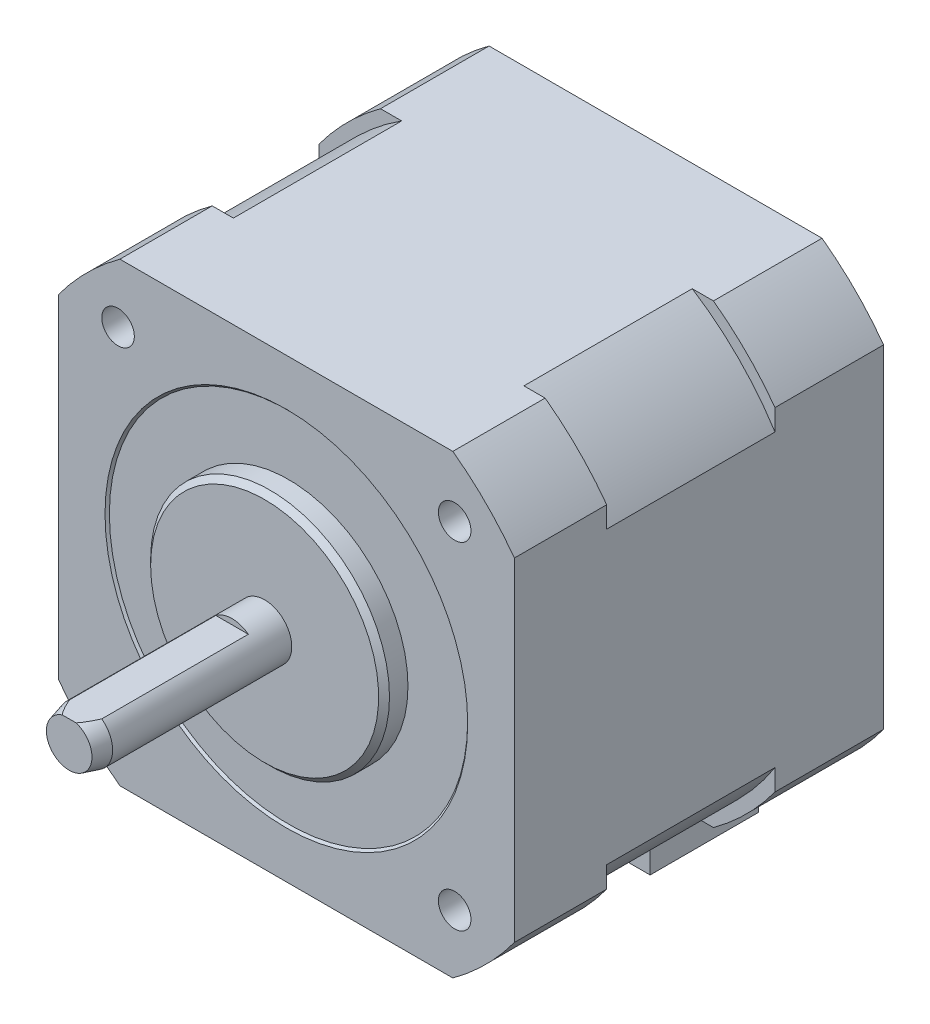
ISO-10303-21;
HEADER;
FILE_DESCRIPTION(('STEP AP214'),'2;1');
FILE_NAME('part.step','',(''),(''),'','','');
FILE_SCHEMA(('AUTOMOTIVE_DESIGN { 1 0 10303 214 1 1 1 1 }'));
ENDSEC;
DATA;
#1=APPLICATION_CONTEXT('core data for automotive mechanical design processes');
#2=APPLICATION_PROTOCOL_DEFINITION('international standard','automotive_design',2000,#1);
#3=PRODUCT_CONTEXT('',#1,'mechanical');
#4=PRODUCT('Part','Part','',(#3));
#5=PRODUCT_RELATED_PRODUCT_CATEGORY('part','',(#4));
#6=PRODUCT_DEFINITION_FORMATION('','',#4);
#7=PRODUCT_DEFINITION_CONTEXT('part definition',#1,'design');
#8=PRODUCT_DEFINITION('design','',#6,#7);
#9=PRODUCT_DEFINITION_SHAPE('','',#8);
#10=(LENGTH_UNIT() NAMED_UNIT(*) SI_UNIT(.MILLI.,.METRE.));
#11=(NAMED_UNIT(*) PLANE_ANGLE_UNIT() SI_UNIT($,.RADIAN.));
#12=(NAMED_UNIT(*) SI_UNIT($,.STERADIAN.) SOLID_ANGLE_UNIT());
#13=UNCERTAINTY_MEASURE_WITH_UNIT(LENGTH_MEASURE(1.E-05),#10,'distance_accuracy_value','');
#14=(GEOMETRIC_REPRESENTATION_CONTEXT(3) GLOBAL_UNCERTAINTY_ASSIGNED_CONTEXT((#13)) GLOBAL_UNIT_ASSIGNED_CONTEXT((#10,
#11,#12)) REPRESENTATION_CONTEXT('',''));
#15=CARTESIAN_POINT('',(0.,0.,0.));
#16=DIRECTION('',(0.,0.,1.));
#17=DIRECTION('',(1.,0.,0.));
#18=AXIS2_PLACEMENT_3D('',#15,#16,#17);
#19=CARTESIAN_POINT('',(0.,0.,-36.));
#20=DIRECTION('',(0.,0.,-1.));
#21=DIRECTION('',(-1.,0.,0.));
#22=AXIS2_PLACEMENT_3D('',#19,#20,#21);
#23=PLANE('',#22);
#24=CARTESIAN_POINT('',(0.,0.,-36.));
#25=DIRECTION('',(0.,0.,-1.));
#26=DIRECTION('',(-1.,0.,0.));
#27=AXIS2_PLACEMENT_3D('',#24,#25,#26);
#28=CIRCLE('',#27,2.5);
#29=CARTESIAN_POINT('',(1.5,2.,-36.));
#30=VERTEX_POINT('',#29);
#31=CARTESIAN_POINT('',(-1.5,2.,-36.));
#32=VERTEX_POINT('',#31);
#33=EDGE_CURVE('E284',#30,#32,#28,.T.);
#34=ORIENTED_EDGE('',*,*,#33,.F.);
#35=DIRECTION('',(-1.,0.,0.));
#36=VECTOR('',#35,1.);
#37=CARTESIAN_POINT('',(5.,2.,-36.));
#38=LINE('',#37,#36);
#39=EDGE_CURVE('E272',#30,#32,#38,.T.);
#40=ORIENTED_EDGE('',*,*,#39,.T.);
#41=EDGE_LOOP('',(#34,#40));
#42=FACE_BOUND('',#41,.T.);
#43=CARTESIAN_POINT('',(0.,0.,-36.));
#44=DIRECTION('',(0.,0.,-1.));
#45=DIRECTION('',(-1.,0.,0.));
#46=AXIS2_PLACEMENT_3D('',#43,#44,#45);
#47=CIRCLE('',#46,26.);
#48=CARTESIAN_POINT('',(15.3297097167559,21.,-36.));
#49=VERTEX_POINT('',#48);
#50=CARTESIAN_POINT('',(21.,15.3297097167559,-36.));
#51=VERTEX_POINT('',#50);
#52=EDGE_CURVE('E321',#49,#51,#47,.T.);
#53=ORIENTED_EDGE('',*,*,#52,.T.);
#54=DIRECTION('',(0.,-1.,0.));
#55=VECTOR('',#54,1.);
#56=CARTESIAN_POINT('',(21.,15.3297097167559,-36.));
#57=LINE('',#56,#55);
#58=CARTESIAN_POINT('',(21.,-15.3297097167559,-36.));
#59=VERTEX_POINT('',#58);
#60=EDGE_CURVE('E324',#51,#59,#57,.T.);
#61=ORIENTED_EDGE('',*,*,#60,.T.);
#62=CARTESIAN_POINT('',(0.,0.,-36.));
#63=DIRECTION('',(0.,0.,-1.));
#64=DIRECTION('',(-1.,0.,0.));
#65=AXIS2_PLACEMENT_3D('',#62,#63,#64);
#66=CIRCLE('',#65,26.);
#67=CARTESIAN_POINT('',(15.3297097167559,-21.,-36.));
#68=VERTEX_POINT('',#67);
#69=EDGE_CURVE('E327',#59,#68,#66,.T.);
#70=ORIENTED_EDGE('',*,*,#69,.T.);
#71=DIRECTION('',(-1.,0.,0.));
#72=VECTOR('',#71,1.);
#73=CARTESIAN_POINT('',(15.3297097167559,-21.,-36.));
#74=LINE('',#73,#72);
#75=CARTESIAN_POINT('',(9.5,-21.,-36.));
#76=VERTEX_POINT('',#75);
#77=EDGE_CURVE('E338',#68,#76,#74,.T.);
#78=ORIENTED_EDGE('',*,*,#77,.T.);
#79=DIRECTION('',(0.,1.,0.));
#80=VECTOR('',#79,1.);
#81=CARTESIAN_POINT('',(9.5,-27.7,-36.));
#82=LINE('',#81,#80);
#83=CARTESIAN_POINT('',(9.5,-27.7,-36.));
#84=VERTEX_POINT('',#83);
#85=EDGE_CURVE('E301',#84,#76,#82,.T.);
#86=ORIENTED_EDGE('',*,*,#85,.F.);
#87=DIRECTION('',(1.,0.,0.));
#88=VECTOR('',#87,1.);
#89=CARTESIAN_POINT('',(-9.5,-27.7,-36.));
#90=LINE('',#89,#88);
#91=CARTESIAN_POINT('',(-9.5,-27.7,-36.));
#92=VERTEX_POINT('',#91);
#93=EDGE_CURVE('E817',#92,#84,#90,.T.);
#94=ORIENTED_EDGE('',*,*,#93,.F.);
#95=DIRECTION('',(0.,1.,0.));
#96=VECTOR('',#95,1.);
#97=CARTESIAN_POINT('',(-9.5,-27.7,-36.));
#98=LINE('',#97,#96);
#99=CARTESIAN_POINT('',(-9.5,-21.0000000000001,-36.));
#100=VERTEX_POINT('',#99);
#101=EDGE_CURVE('E306',#92,#100,#98,.T.);
#102=ORIENTED_EDGE('',*,*,#101,.T.);
#103=CARTESIAN_POINT('',(-15.3297097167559,-21.,-36.));
#104=VERTEX_POINT('',#103);
#105=EDGE_CURVE('E329',#100,#104,#74,.T.);
#106=ORIENTED_EDGE('',*,*,#105,.T.);
#107=CARTESIAN_POINT('',(0.,0.,-36.));
#108=DIRECTION('',(0.,0.,-1.));
#109=DIRECTION('',(-1.,0.,0.));
#110=AXIS2_PLACEMENT_3D('',#107,#108,#109);
#111=CIRCLE('',#110,26.);
#112=CARTESIAN_POINT('',(-21.,-15.3297097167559,-36.));
#113=VERTEX_POINT('',#112);
#114=EDGE_CURVE('E332',#104,#113,#111,.T.);
#115=ORIENTED_EDGE('',*,*,#114,.T.);
#116=DIRECTION('',(0.,1.,0.));
#117=VECTOR('',#116,1.);
#118=CARTESIAN_POINT('',(-21.,-15.3297097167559,-36.));
#119=LINE('',#118,#117);
#120=CARTESIAN_POINT('',(-21.,15.3297097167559,-36.));
#121=VERTEX_POINT('',#120);
#122=EDGE_CURVE('E786',#113,#121,#119,.T.);
#123=ORIENTED_EDGE('',*,*,#122,.T.);
#124=CARTESIAN_POINT('',(0.,0.,-36.));
#125=DIRECTION('',(0.,0.,-1.));
#126=DIRECTION('',(-1.,0.,0.));
#127=AXIS2_PLACEMENT_3D('',#124,#125,#126);
#128=CIRCLE('',#127,26.);
#129=CARTESIAN_POINT('',(-15.3297097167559,21.,-36.));
#130=VERTEX_POINT('',#129);
#131=EDGE_CURVE('E784',#121,#130,#128,.T.);
#132=ORIENTED_EDGE('',*,*,#131,.T.);
#133=DIRECTION('',(1.,0.,0.));
#134=VECTOR('',#133,1.);
#135=CARTESIAN_POINT('',(-15.3297097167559,21.,-36.));
#136=LINE('',#135,#134);
#137=EDGE_CURVE('E779',#130,#49,#136,.T.);
#138=ORIENTED_EDGE('',*,*,#137,.T.);
#139=EDGE_LOOP('',(#53,#61,#70,#78,#86,#94,#102,#106,#115,#123,#132,#138));
#140=FACE_BOUND('',#139,.T.);
#141=ADVANCED_FACE('F38',(#42,#140),#23,.T.);
#142=CARTESIAN_POINT('',(21.,-21.,-10.5));
#143=DIRECTION('',(0.,1.,0.));
#144=DIRECTION('',(-1.,0.,0.));
#145=AXIS2_PLACEMENT_3D('',#142,#143,#144);
#146=PLANE('',#145);
#147=DIRECTION('',(0.,0.,-1.));
#148=VECTOR('',#147,1.);
#149=CARTESIAN_POINT('',(-9.5,-21.,-26.));
#150=LINE('',#149,#148);
#151=CARTESIAN_POINT('',(-9.5,-21.,-26.));
#152=VERTEX_POINT('',#151);
#153=EDGE_CURVE('E65',#152,#100,#150,.T.);
#154=ORIENTED_EDGE('',*,*,#153,.F.);
#155=DIRECTION('',(-1.,0.,0.));
#156=VECTOR('',#155,1.);
#157=CARTESIAN_POINT('',(-9.5,-21.,-26.));
#158=LINE('',#157,#156);
#159=CARTESIAN_POINT('',(9.5,-21.,-26.));
#160=VERTEX_POINT('',#159);
#161=EDGE_CURVE('E292',#160,#152,#158,.T.);
#162=ORIENTED_EDGE('',*,*,#161,.F.);
#163=DIRECTION('',(0.,0.,1.));
#164=VECTOR('',#163,1.);
#165=CARTESIAN_POINT('',(9.5,-21.,-26.));
#166=LINE('',#165,#164);
#167=EDGE_CURVE('E283',#76,#160,#166,.T.);
#168=ORIENTED_EDGE('',*,*,#167,.F.);
#169=ORIENTED_EDGE('',*,*,#77,.F.);
#170=DIRECTION('',(0.,0.,1.));
#171=VECTOR('',#170,1.);
#172=CARTESIAN_POINT('',(15.3297097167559,-21.,-36.));
#173=LINE('',#172,#171);
#174=CARTESIAN_POINT('',(15.3297097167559,-21.,-26.));
#175=VERTEX_POINT('',#174);
#176=EDGE_CURVE('E764',#68,#175,#173,.T.);
#177=ORIENTED_EDGE('',*,*,#176,.T.);
#178=DIRECTION('',(-1.,0.,0.));
#179=VECTOR('',#178,1.);
#180=CARTESIAN_POINT('',(-13.3794618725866,-21.,-26.));
#181=LINE('',#180,#179);
#182=CARTESIAN_POINT('',(13.3794618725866,-21.,-26.));
#183=VERTEX_POINT('',#182);
#184=EDGE_CURVE('E741',#175,#183,#181,.T.);
#185=ORIENTED_EDGE('',*,*,#184,.T.);
#186=DIRECTION('',(0.,0.,1.));
#187=VECTOR('',#186,1.);
#188=CARTESIAN_POINT('',(13.3794618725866,-21.,-26.));
#189=LINE('',#188,#187);
#190=CARTESIAN_POINT('',(13.3794618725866,-21.,-10.5));
#191=VERTEX_POINT('',#190);
#192=EDGE_CURVE('E599',#183,#191,#189,.T.);
#193=ORIENTED_EDGE('',*,*,#192,.T.);
#194=DIRECTION('',(-1.,0.,0.));
#195=VECTOR('',#194,1.);
#196=CARTESIAN_POINT('',(21.,-21.,-10.5));
#197=LINE('',#196,#195);
#198=CARTESIAN_POINT('',(15.3297097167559,-21.,-10.5));
#199=VERTEX_POINT('',#198);
#200=EDGE_CURVE('E503',#199,#191,#197,.T.);
#201=ORIENTED_EDGE('',*,*,#200,.F.);
#202=DIRECTION('',(0.,0.,1.));
#203=VECTOR('',#202,1.);
#204=CARTESIAN_POINT('',(15.3297097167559,-21.,-36.));
#205=LINE('',#204,#203);
#206=CARTESIAN_POINT('',(15.3297097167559,-21.,-2.));
#207=VERTEX_POINT('',#206);
#208=EDGE_CURVE('E567',#207,#199,#205,.F.);
#209=ORIENTED_EDGE('',*,*,#208,.F.);
#210=DIRECTION('',(-1.,0.,0.));
#211=VECTOR('',#210,1.);
#212=CARTESIAN_POINT('',(21.,-21.,-2.));
#213=LINE('',#212,#211);
#214=CARTESIAN_POINT('',(-15.3297097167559,-21.,-2.));
#215=VERTEX_POINT('',#214);
#216=EDGE_CURVE('E512',#207,#215,#213,.T.);
#217=ORIENTED_EDGE('',*,*,#216,.T.);
#218=DIRECTION('',(0.,0.,1.));
#219=VECTOR('',#218,1.);
#220=CARTESIAN_POINT('',(-15.3297097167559,-21.,-36.));
#221=LINE('',#220,#219);
#222=CARTESIAN_POINT('',(-15.3297097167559,-21.,-10.5));
#223=VERTEX_POINT('',#222);
#224=EDGE_CURVE('E571',#223,#215,#221,.T.);
#225=ORIENTED_EDGE('',*,*,#224,.F.);
#226=CARTESIAN_POINT('',(-13.3794618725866,-21.,-10.5));
#227=VERTEX_POINT('',#226);
#228=EDGE_CURVE('E509',#227,#223,#197,.T.);
#229=ORIENTED_EDGE('',*,*,#228,.F.);
#230=DIRECTION('',(0.,0.,1.));
#231=VECTOR('',#230,1.);
#232=CARTESIAN_POINT('',(-13.3794618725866,-21.,-26.));
#233=LINE('',#232,#231);
#234=CARTESIAN_POINT('',(-13.3794618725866,-21.,-26.));
#235=VERTEX_POINT('',#234);
#236=EDGE_CURVE('E1276',#235,#227,#233,.T.);
#237=ORIENTED_EDGE('',*,*,#236,.F.);
#238=CARTESIAN_POINT('',(-15.3297097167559,-21.,-26.));
#239=VERTEX_POINT('',#238);
#240=EDGE_CURVE('E734',#235,#239,#181,.T.);
#241=ORIENTED_EDGE('',*,*,#240,.T.);
#242=DIRECTION('',(0.,0.,1.));
#243=VECTOR('',#242,1.);
#244=CARTESIAN_POINT('',(-15.3297097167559,-21.,-36.));
#245=LINE('',#244,#243);
#246=EDGE_CURVE('E767',#104,#239,#245,.T.);
#247=ORIENTED_EDGE('',*,*,#246,.F.);
#248=ORIENTED_EDGE('',*,*,#105,.F.);
#249=EDGE_LOOP('',(#154,#162,#168,#169,#177,#185,#193,#201,#209,#217,#225,#229,#237,#241,#247,#248));
#250=FACE_BOUND('',#249,.T.);
#251=ADVANCED_FACE('F373',(#250),#146,.F.);
#252=CARTESIAN_POINT('',(0.,0.,18.));
#253=DIRECTION('',(0.,0.,-1.));
#254=DIRECTION('',(-1.,0.,0.));
#255=AXIS2_PLACEMENT_3D('',#252,#253,#254);
#256=CYLINDRICAL_SURFACE('',#255,2.5);
#257=CARTESIAN_POINT('',(0.,0.,16.4999999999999));
#258=DIRECTION('',(0.,0.,1.));
#259=DIRECTION('',(1.,0.,0.));
#260=AXIS2_PLACEMENT_3D('',#257,#258,#259);
#261=CIRCLE('',#260,2.5);
#262=CARTESIAN_POINT('',(1.5,2.,16.4999999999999));
#263=VERTEX_POINT('',#262);
#264=CARTESIAN_POINT('',(-1.49999999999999,2.,16.4999999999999));
#265=VERTEX_POINT('',#264);
#266=EDGE_CURVE('E356',#263,#265,#261,.F.);
#267=ORIENTED_EDGE('',*,*,#266,.T.);
#268=DIRECTION('',(0.,0.,-1.));
#269=VECTOR('',#268,1.);
#270=CARTESIAN_POINT('',(-1.5,2.,18.));
#271=LINE('',#270,#269);
#272=CARTESIAN_POINT('',(-1.5,2.,3.));
#273=VERTEX_POINT('',#272);
#274=EDGE_CURVE('E317',#265,#273,#271,.T.);
#275=ORIENTED_EDGE('',*,*,#274,.T.);
#276=CARTESIAN_POINT('',(0.,0.,3.));
#277=DIRECTION('',(0.,0.,1.));
#278=DIRECTION('',(1.,0.,0.));
#279=AXIS2_PLACEMENT_3D('',#276,#277,#278);
#280=CIRCLE('',#279,2.5);
#281=CARTESIAN_POINT('',(1.5,2.,3.));
#282=VERTEX_POINT('',#281);
#283=EDGE_CURVE('E346',#282,#273,#280,.T.);
#284=ORIENTED_EDGE('',*,*,#283,.F.);
#285=DIRECTION('',(0.,0.,-1.));
#286=VECTOR('',#285,1.);
#287=CARTESIAN_POINT('',(1.5,2.,18.));
#288=LINE('',#287,#286);
#289=EDGE_CURVE('E313',#282,#263,#288,.F.);
#290=ORIENTED_EDGE('',*,*,#289,.T.);
#291=EDGE_LOOP('',(#267,#275,#284,#290));
#292=FACE_BOUND('',#291,.T.);
#293=CARTESIAN_POINT('',(0.,0.,0.));
#294=DIRECTION('',(0.,0.,-1.));
#295=DIRECTION('',(-1.,0.,0.));
#296=AXIS2_PLACEMENT_3D('',#293,#294,#295);
#297=CIRCLE('',#296,2.5);
#298=CARTESIAN_POINT('',(-2.5,0.,0.));
#299=VERTEX_POINT('',#298);
#300=EDGE_CURVE('E500',#299,#299,#297,.T.);
#301=ORIENTED_EDGE('',*,*,#300,.F.);
#302=EDGE_LOOP('',(#301));
#303=FACE_BOUND('',#302,.T.);
#304=ADVANCED_FACE('F468',(#292,#303),#256,.T.);
#305=CARTESIAN_POINT('',(0.,0.,18.));
#306=DIRECTION('',(0.,0.,1.));
#307=DIRECTION('',(1.,0.,0.));
#308=AXIS2_PLACEMENT_3D('',#305,#306,#307);
#309=PLANE('',#308);
#310=DIRECTION('',(1.,0.,0.));
#311=VECTOR('',#310,1.);
#312=CARTESIAN_POINT('',(-4.72781232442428,2.,18.));
#313=LINE('',#312,#311);
#314=CARTESIAN_POINT('',(-0.633974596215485,2.,18.));
#315=VERTEX_POINT('',#314);
#316=CARTESIAN_POINT('',(0.633974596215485,2.,18.));
#317=VERTEX_POINT('',#316);
#318=EDGE_CURVE('E309',#315,#317,#313,.T.);
#319=ORIENTED_EDGE('',*,*,#318,.F.);
#320=CARTESIAN_POINT('',(0.,0.,18.));
#321=DIRECTION('',(0.,0.,1.));
#322=DIRECTION('',(1.,0.,0.));
#323=AXIS2_PLACEMENT_3D('',#320,#321,#322);
#324=CIRCLE('',#323,2.09807621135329);
#325=EDGE_CURVE('E1241',#315,#317,#324,.T.);
#326=ORIENTED_EDGE('',*,*,#325,.T.);
#327=EDGE_LOOP('',(#319,#326));
#328=FACE_BOUND('',#327,.T.);
#329=ADVANCED_FACE('F484',(#328),#309,.T.);
#330=CARTESIAN_POINT('',(0.,0.,0.));
#331=DIRECTION('',(0.,0.,-1.));
#332=DIRECTION('',(-1.,0.,0.));
#333=AXIS2_PLACEMENT_3D('',#330,#331,#332);
#334=PLANE('',#333);
#335=CARTESIAN_POINT('',(0.,0.,0.));
#336=DIRECTION('',(0.,0.,-1.));
#337=DIRECTION('',(-1.,0.,0.));
#338=AXIS2_PLACEMENT_3D('',#335,#336,#337);
#339=CIRCLE('',#338,10.5);
#340=CARTESIAN_POINT('',(-10.5,0.,0.));
#341=VERTEX_POINT('',#340);
#342=EDGE_CURVE('E278',#341,#341,#339,.F.);
#343=ORIENTED_EDGE('',*,*,#342,.T.);
#344=EDGE_LOOP('',(#343));
#345=FACE_BOUND('',#344,.T.);
#346=ORIENTED_EDGE('',*,*,#300,.T.);
#347=EDGE_LOOP('',(#346));
#348=FACE_BOUND('',#347,.T.);
#349=ADVANCED_FACE('F480',(#345,#348),#334,.F.);
#350=CARTESIAN_POINT('',(0.,0.,-2.));
#351=DIRECTION('',(0.,0.,1.));
#352=DIRECTION('',(1.,0.,0.));
#353=AXIS2_PLACEMENT_3D('',#350,#351,#352);
#354=CYLINDRICAL_SURFACE('',#353,11.);
#355=CARTESIAN_POINT('',(0.,0.,-0.500000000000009));
#356=DIRECTION('',(0.,0.,-1.));
#357=DIRECTION('',(-1.,0.,0.));
#358=AXIS2_PLACEMENT_3D('',#355,#356,#357);
#359=CIRCLE('',#358,11.);
#360=CARTESIAN_POINT('',(-11.,0.,-0.500000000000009));
#361=VERTEX_POINT('',#360);
#362=EDGE_CURVE('E343',#361,#361,#359,.T.);
#363=ORIENTED_EDGE('',*,*,#362,.T.);
#364=EDGE_LOOP('',(#363));
#365=FACE_BOUND('',#364,.T.);
#366=CARTESIAN_POINT('',(0.,0.,-2.2));
#367=DIRECTION('',(0.,0.,1.));
#368=DIRECTION('',(1.,0.,0.));
#369=AXIS2_PLACEMENT_3D('',#366,#367,#368);
#370=CIRCLE('',#369,11.);
#371=CARTESIAN_POINT('',(11.,0.,-2.2));
#372=VERTEX_POINT('',#371);
#373=EDGE_CURVE('E302',#372,#372,#370,.T.);
#374=ORIENTED_EDGE('',*,*,#373,.T.);
#375=EDGE_LOOP('',(#374));
#376=FACE_BOUND('',#375,.T.);
#377=ADVANCED_FACE('F483',(#365,#376),#354,.T.);
#378=CARTESIAN_POINT('',(0.,0.,18.));
#379=DIRECTION('',(0.,0.,-1.));
#380=DIRECTION('',(-1.,0.,0.));
#381=AXIS2_PLACEMENT_3D('',#378,#379,#380);
#382=CONICAL_SURFACE('',#381,2.09807621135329,0.261799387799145);
#383=CARTESIAN_POINT('',(-2.67411513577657,2.,13.3677080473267));
#384=CARTESIAN_POINT('',(-2.63311786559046,2.,13.4902257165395));
#385=CARTESIAN_POINT('',(-2.59182160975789,2.,13.6126436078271));
#386=CARTESIAN_POINT('',(-2.50853023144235,2.,13.8572444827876));
#387=CARTESIAN_POINT('',(-2.46653509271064,2.,13.9794274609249));
#388=CARTESIAN_POINT('',(-2.33928264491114,2.,14.34576464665));
#389=CARTESIAN_POINT('',(-2.25282589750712,2.,14.5895039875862));
#390=CARTESIAN_POINT('',(-2.07457613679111,2.,15.0781045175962));
#391=CARTESIAN_POINT('',(-1.98273458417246,2.,15.3229481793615));
#392=CARTESIAN_POINT('',(-1.84011140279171,2.,15.688262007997));
#393=CARTESIAN_POINT('',(-1.79177038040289,2.,15.8096838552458));
#394=CARTESIAN_POINT('',(-1.6930545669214,2.,16.0516959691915));
#395=CARTESIAN_POINT('',(-1.64267985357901,2.,16.1722862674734));
#396=CARTESIAN_POINT('',(-1.53950262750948,2.,16.4120087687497));
#397=CARTESIAN_POINT('',(-1.4867076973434,2.,16.5311442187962));
#398=CARTESIAN_POINT('',(-1.37773401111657,2.,16.7679408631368));
#399=CARTESIAN_POINT('',(-1.32155357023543,2.,16.8856012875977));
#400=CARTESIAN_POINT('',(-1.20458285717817,2.,17.1187131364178));
#401=CARTESIAN_POINT('',(-1.14379017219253,2.,17.2341633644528));
#402=CARTESIAN_POINT('',(-1.01570284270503,2.,17.4612984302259));
#403=CARTESIAN_POINT('',(-0.948415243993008,2.,17.5729871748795));
#404=CARTESIAN_POINT('',(-0.817363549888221,2.,17.7692701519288));
#405=CARTESIAN_POINT('',(-0.755348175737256,2.,17.8549879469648));
#406=CARTESIAN_POINT('',(-0.654778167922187,2.,17.9770588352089));
#407=CARTESIAN_POINT('',(-0.620094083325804,2.,18.0165731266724));
#408=CARTESIAN_POINT('',(-0.547506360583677,2.,18.092493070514));
#409=CARTESIAN_POINT('',(-0.509607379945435,2.,18.1289030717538));
#410=CARTESIAN_POINT('',(-0.439829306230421,2.,18.1884315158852));
#411=CARTESIAN_POINT('',(-0.408844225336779,2.,18.212585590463));
#412=CARTESIAN_POINT('',(-0.344218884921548,2.,18.2572111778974));
#413=CARTESIAN_POINT('',(-0.310575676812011,2.,18.2776785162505));
#414=CARTESIAN_POINT('',(-0.240012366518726,2.,18.3136158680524));
#415=CARTESIAN_POINT('',(-0.203051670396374,2.,18.3290087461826));
#416=CARTESIAN_POINT('',(-0.126881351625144,2.,18.3523462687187));
#417=CARTESIAN_POINT('',(-0.0876800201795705,2.,18.3603166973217));
#418=CARTESIAN_POINT('',(-0.0127311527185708,2.,18.367039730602));
#419=CARTESIAN_POINT('',(0.0229341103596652,2.,18.3666919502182));
#420=CARTESIAN_POINT('',(0.0935290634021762,2.,18.3590326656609));
#421=CARTESIAN_POINT('',(0.12845758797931,2.,18.3517108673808));
#422=CARTESIAN_POINT('',(0.201815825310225,2.,18.329553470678));
#423=CARTESIAN_POINT('',(0.239935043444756,2.,18.3137192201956));
#424=CARTESIAN_POINT('',(0.313185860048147,2.,18.276283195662));
#425=CARTESIAN_POINT('',(0.348311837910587,2.,18.2546708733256));
#426=CARTESIAN_POINT('',(0.443923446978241,2.,18.1877621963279));
#427=CARTESIAN_POINT('',(0.501075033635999,2.,18.1377652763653));
#428=CARTESIAN_POINT('',(0.581429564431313,2.,18.0575943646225));
#429=CARTESIAN_POINT('',(0.607372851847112,2.,18.0299378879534));
#430=CARTESIAN_POINT('',(0.657731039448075,2.,17.9732675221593));
#431=CARTESIAN_POINT('',(0.682146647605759,2.,17.9442542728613));
#432=CARTESIAN_POINT('',(0.749893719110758,2.,17.8601101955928));
#433=CARTESIAN_POINT('',(0.791668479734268,2.,17.8037362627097));
#434=CARTESIAN_POINT('',(0.871939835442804,2.,17.6886841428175));
#435=CARTESIAN_POINT('',(0.910434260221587,2.,17.6300044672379));
#436=CARTESIAN_POINT('',(0.984949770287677,2.,17.5109259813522));
#437=CARTESIAN_POINT('',(1.02096523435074,2.,17.4505236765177));
#438=CARTESIAN_POINT('',(1.09096213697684,2.,17.3285472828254));
#439=CARTESIAN_POINT('',(1.12494324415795,2.,17.2669730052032));
#440=CARTESIAN_POINT('',(1.2249539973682,2.,17.0799665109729));
#441=CARTESIAN_POINT('',(1.28847862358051,2.,16.9531970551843));
#442=CARTESIAN_POINT('',(1.41085483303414,2.,16.6976781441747));
#443=CARTESIAN_POINT('',(1.46971282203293,2.,16.5689317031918));
#444=CARTESIAN_POINT('',(1.58310001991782,2.,16.3121463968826));
#445=CARTESIAN_POINT('',(1.63768554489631,2.,16.1841322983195));
#446=CARTESIAN_POINT('',(1.74436311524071,2.,15.9270663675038));
#447=CARTESIAN_POINT('',(1.79645500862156,2.,15.7980144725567));
#448=CARTESIAN_POINT('',(1.94989108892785,2.,15.4094944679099));
#449=CARTESIAN_POINT('',(2.04830566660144,2.,15.1488712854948));
#450=CARTESIAN_POINT('',(2.23648040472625,2.,14.6352664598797));
#451=CARTESIAN_POINT('',(2.32642514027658,2.,14.3823515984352));
#452=CARTESIAN_POINT('',(2.45867006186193,2.,14.0022493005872));
#453=CARTESIAN_POINT('',(2.50227709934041,2.,13.8755147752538));
#454=CARTESIAN_POINT('',(2.58873482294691,2.,13.6217918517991));
#455=CARTESIAN_POINT('',(2.63158553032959,2.,13.4948034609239));
#456=CARTESIAN_POINT('',(2.67411513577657,2.,13.3677080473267));
#457=B_SPLINE_CURVE_WITH_KNOTS('',3,(#383,#384,#385,#386,#387,#388,#389,#390,#391,#392,#393,
#394,#395,#396,#397,#398,#399,#400,#401,#402,#403,#404,#405,#406,#407,#408,#409,#410,#411,#412,
#413,#414,#415,#416,#417,#418,#419,#420,#421,#422,#423,#424,#425,#426,#427,#428,#429,#430,#431,
#432,#433,#434,#435,#436,#437,#438,#439,#440,#441,#442,#443,#444,#445,#446,#447,#448,#449,#450,
#451,#452,#453,#454,#455,#456),.UNSPECIFIED.,.F.,.F.,(4,2,2,2,2,2,2,2,2,2,2,2,2,2,2,2,2,2,2,2,2,
2,2,2,2,2,2,2,2,2,2,2,2,2,2,2,4),(0.,0.38758488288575,0.775178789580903,1.5510087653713,
2.33544116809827,2.72750017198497,3.11954420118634,3.51043426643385,3.90152049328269,
4.2928127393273,4.68368517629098,5.00048531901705,5.15809093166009,5.31547199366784,
5.4331414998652,5.55094341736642,5.67046127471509,5.78956238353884,5.89584731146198,
6.00228936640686,6.12543181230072,6.24880061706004,6.47525140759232,6.58900607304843,
6.70270762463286,6.91302983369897,7.12349013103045,7.33441292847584,7.54536999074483,
7.97059745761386,8.39523074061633,8.81269313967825,9.23018095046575,10.0658395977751,
10.8711084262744,11.2731870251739,11.675254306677),.UNSPECIFIED.);
#458=EDGE_CURVE('E348',#265,#315,#457,.T.);
#459=ORIENTED_EDGE('',*,*,#458,.F.);
#460=ORIENTED_EDGE('',*,*,#266,.F.);
#461=EDGE_CURVE('E349',#317,#263,#457,.T.);
#462=ORIENTED_EDGE('',*,*,#461,.F.);
#463=ORIENTED_EDGE('',*,*,#325,.F.);
#464=EDGE_LOOP('',(#459,#460,#462,#463));
#465=FACE_BOUND('',#464,.T.);
#466=ADVANCED_FACE('F358',(#465),#382,.T.);
#467=CARTESIAN_POINT('',(0.,0.,3.));
#468=DIRECTION('',(0.,0.,1.));
#469=DIRECTION('',(1.,0.,0.));
#470=AXIS2_PLACEMENT_3D('',#467,#468,#469);
#471=PLANE('',#470);
#472=ORIENTED_EDGE('',*,*,#283,.T.);
#473=DIRECTION('',(1.,0.,0.));
#474=VECTOR('',#473,1.);
#475=CARTESIAN_POINT('',(-4.72781232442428,2.,3.));
#476=LINE('',#475,#474);
#477=EDGE_CURVE('E310',#273,#282,#476,.T.);
#478=ORIENTED_EDGE('',*,*,#477,.T.);
#479=EDGE_LOOP('',(#472,#478));
#480=FACE_BOUND('',#479,.T.);
#481=ADVANCED_FACE('F368',(#480),#471,.T.);
#482=CARTESIAN_POINT('',(-4.72781232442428,2.,3.));
#483=DIRECTION('',(0.,-1.,0.));
#484=DIRECTION('',(0.,0.,-1.));
#485=AXIS2_PLACEMENT_3D('',#482,#483,#484);
#486=PLANE('',#485);
#487=ORIENTED_EDGE('',*,*,#458,.T.);
#488=ORIENTED_EDGE('',*,*,#318,.T.);
#489=ORIENTED_EDGE('',*,*,#461,.T.);
#490=ORIENTED_EDGE('',*,*,#289,.F.);
#491=ORIENTED_EDGE('',*,*,#477,.F.);
#492=ORIENTED_EDGE('',*,*,#274,.F.);
#493=EDGE_LOOP('',(#487,#488,#489,#490,#491,#492));
#494=FACE_BOUND('',#493,.T.);
#495=ADVANCED_FACE('F362',(#494),#486,.F.);
#496=CARTESIAN_POINT('',(0.,0.,-2.2));
#497=DIRECTION('',(0.,0.,1.));
#498=DIRECTION('',(1.,0.,0.));
#499=AXIS2_PLACEMENT_3D('',#496,#497,#498);
#500=PLANE('',#499);
#501=ORIENTED_EDGE('',*,*,#373,.F.);
#502=EDGE_LOOP('',(#501));
#503=FACE_BOUND('',#502,.T.);
#504=CARTESIAN_POINT('',(0.,0.,-2.2));
#505=DIRECTION('',(0.,0.,1.));
#506=DIRECTION('',(1.,0.,0.));
#507=AXIS2_PLACEMENT_3D('',#504,#505,#506);
#508=CIRCLE('',#507,16.5);
#509=CARTESIAN_POINT('',(16.5,0.,-2.2));
#510=VERTEX_POINT('',#509);
#511=EDGE_CURVE('E305',#510,#510,#508,.T.);
#512=ORIENTED_EDGE('',*,*,#511,.T.);
#513=EDGE_LOOP('',(#512));
#514=FACE_BOUND('',#513,.T.);
#515=ADVANCED_FACE('F367',(#503,#514),#500,.T.);
#516=CARTESIAN_POINT('',(-21.,-21.,-10.5));
#517=DIRECTION('',(0.,0.,-1.));
#518=DIRECTION('',(-1.,0.,0.));
#519=AXIS2_PLACEMENT_3D('',#516,#517,#518);
#520=PLANE('',#519);
#521=CARTESIAN_POINT('',(0.,0.,-10.5));
#522=DIRECTION('',(0.,0.,-1.));
#523=DIRECTION('',(-1.,0.,0.));
#524=AXIS2_PLACEMENT_3D('',#521,#522,#523);
#525=CIRCLE('',#524,24.9);
#526=CARTESIAN_POINT('',(13.3794618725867,21.,-10.5));
#527=VERTEX_POINT('',#526);
#528=CARTESIAN_POINT('',(21.,13.3794618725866,-10.5));
#529=VERTEX_POINT('',#528);
#530=EDGE_CURVE('E549',#527,#529,#525,.T.);
#531=ORIENTED_EDGE('',*,*,#530,.F.);
#532=DIRECTION('',(1.,0.,0.));
#533=VECTOR('',#532,1.);
#534=CARTESIAN_POINT('',(21.,21.,-10.5));
#535=LINE('',#534,#533);
#536=CARTESIAN_POINT('',(15.3297097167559,21.,-10.5));
#537=VERTEX_POINT('',#536);
#538=EDGE_CURVE('E518',#527,#537,#535,.T.);
#539=ORIENTED_EDGE('',*,*,#538,.T.);
#540=CARTESIAN_POINT('',(0.,0.,-10.5));
#541=DIRECTION('',(0.,0.,-1.));
#542=DIRECTION('',(-1.,0.,0.));
#543=AXIS2_PLACEMENT_3D('',#540,#541,#542);
#544=CIRCLE('',#543,26.);
#545=CARTESIAN_POINT('',(21.,15.3297097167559,-10.5));
#546=VERTEX_POINT('',#545);
#547=EDGE_CURVE('E546',#537,#546,#544,.T.);
#548=ORIENTED_EDGE('',*,*,#547,.T.);
#549=DIRECTION('',(0.,-1.,0.));
#550=VECTOR('',#549,1.);
#551=CARTESIAN_POINT('',(21.,21.,-10.5));
#552=LINE('',#551,#550);
#553=EDGE_CURVE('E540',#546,#529,#552,.T.);
#554=ORIENTED_EDGE('',*,*,#553,.T.);
#555=EDGE_LOOP('',(#531,#539,#548,#554));
#556=FACE_BOUND('',#555,.T.);
#557=ADVANCED_FACE('F404',(#556),#520,.T.);
#558=CARTESIAN_POINT('',(0.,0.,-26.));
#559=DIRECTION('',(0.,0.,1.));
#560=DIRECTION('',(1.,0.,0.));
#561=AXIS2_PLACEMENT_3D('',#558,#559,#560);
#562=CYLINDRICAL_SURFACE('',#561,24.9);
#563=ORIENTED_EDGE('',*,*,#530,.T.);
#564=DIRECTION('',(0.,0.,1.));
#565=VECTOR('',#564,1.);
#566=CARTESIAN_POINT('',(21.,13.3794618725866,-26.));
#567=LINE('',#566,#565);
#568=CARTESIAN_POINT('',(21.0000000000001,13.3794618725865,-26.));
#569=VERTEX_POINT('',#568);
#570=EDGE_CURVE('E613',#569,#529,#567,.T.);
#571=ORIENTED_EDGE('',*,*,#570,.F.);
#572=CARTESIAN_POINT('',(0.,0.,-26.));
#573=DIRECTION('',(0.,0.,-1.));
#574=DIRECTION('',(-1.,0.,0.));
#575=AXIS2_PLACEMENT_3D('',#572,#573,#574);
#576=CIRCLE('',#575,24.9);
#577=CARTESIAN_POINT('',(13.3794618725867,21.,-26.));
#578=VERTEX_POINT('',#577);
#579=EDGE_CURVE('E636',#578,#569,#576,.T.);
#580=ORIENTED_EDGE('',*,*,#579,.F.);
#581=DIRECTION('',(0.,0.,1.));
#582=VECTOR('',#581,1.);
#583=CARTESIAN_POINT('',(13.3794618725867,21.,-26.));
#584=LINE('',#583,#582);
#585=EDGE_CURVE('E616',#578,#527,#584,.T.);
#586=ORIENTED_EDGE('',*,*,#585,.T.);
#587=EDGE_LOOP('',(#563,#571,#580,#586));
#588=FACE_BOUND('',#587,.T.);
#589=ADVANCED_FACE('F401',(#588),#562,.T.);
#590=CARTESIAN_POINT('',(0.,0.,-26.));
#591=DIRECTION('',(0.,0.,-1.));
#592=DIRECTION('',(-1.,0.,0.));
#593=AXIS2_PLACEMENT_3D('',#590,#591,#592);
#594=PLANE('',#593);
#595=DIRECTION('',(1.,0.,0.));
#596=VECTOR('',#595,1.);
#597=CARTESIAN_POINT('',(13.3794618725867,21.,-26.));
#598=LINE('',#597,#596);
#599=CARTESIAN_POINT('',(15.3297097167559,21.,-26.));
#600=VERTEX_POINT('',#599);
#601=EDGE_CURVE('E752',#578,#600,#598,.T.);
#602=ORIENTED_EDGE('',*,*,#601,.F.);
#603=ORIENTED_EDGE('',*,*,#579,.T.);
#604=DIRECTION('',(0.,-1.,0.));
#605=VECTOR('',#604,1.);
#606=CARTESIAN_POINT('',(21.,-13.3794618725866,-26.));
#607=LINE('',#606,#605);
#608=CARTESIAN_POINT('',(21.,15.3297097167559,-26.));
#609=VERTEX_POINT('',#608);
#610=EDGE_CURVE('E724',#609,#569,#607,.T.);
#611=ORIENTED_EDGE('',*,*,#610,.F.);
#612=CARTESIAN_POINT('',(0.,0.,-26.));
#613=DIRECTION('',(0.,0.,-1.));
#614=DIRECTION('',(-1.,0.,0.));
#615=AXIS2_PLACEMENT_3D('',#612,#613,#614);
#616=CIRCLE('',#615,26.);
#617=EDGE_CURVE('E320',#600,#609,#616,.T.);
#618=ORIENTED_EDGE('',*,*,#617,.F.);
#619=EDGE_LOOP('',(#602,#603,#611,#618));
#620=FACE_BOUND('',#619,.T.);
#621=ADVANCED_FACE('F382',(#620),#594,.F.);
#622=CARTESIAN_POINT('',(0.,0.,-36.));
#623=DIRECTION('',(0.,0.,1.));
#624=DIRECTION('',(1.,0.,0.));
#625=AXIS2_PLACEMENT_3D('',#622,#623,#624);
#626=CYLINDRICAL_SURFACE('',#625,26.);
#627=ORIENTED_EDGE('',*,*,#617,.T.);
#628=DIRECTION('',(0.,0.,1.));
#629=VECTOR('',#628,1.);
#630=CARTESIAN_POINT('',(21.,15.3297097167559,-36.));
#631=LINE('',#630,#629);
#632=EDGE_CURVE('E653',#51,#609,#631,.T.);
#633=ORIENTED_EDGE('',*,*,#632,.F.);
#634=ORIENTED_EDGE('',*,*,#52,.F.);
#635=DIRECTION('',(0.,0.,1.));
#636=VECTOR('',#635,1.);
#637=CARTESIAN_POINT('',(15.3297097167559,21.,-36.));
#638=LINE('',#637,#636);
#639=EDGE_CURVE('E755',#49,#600,#638,.T.);
#640=ORIENTED_EDGE('',*,*,#639,.T.);
#641=EDGE_LOOP('',(#627,#633,#634,#640));
#642=FACE_BOUND('',#641,.T.);
#643=ADVANCED_FACE('F396',(#642),#626,.T.);
#644=CARTESIAN_POINT('',(0.,0.,-10.5));
#645=DIRECTION('',(0.,0.,-1.));
#646=DIRECTION('',(-1.,0.,0.));
#647=AXIS2_PLACEMENT_3D('',#644,#645,#646);
#648=CIRCLE('',#647,24.9);
#649=CARTESIAN_POINT('',(21.,-13.3794618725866,-10.5));
#650=VERTEX_POINT('',#649);
#651=EDGE_CURVE('E650',#650,#191,#648,.T.);
#652=ORIENTED_EDGE('',*,*,#651,.F.);
#653=CARTESIAN_POINT('',(21.,-15.3297097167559,-10.5));
#654=VERTEX_POINT('',#653);
#655=EDGE_CURVE('E535',#650,#654,#552,.T.);
#656=ORIENTED_EDGE('',*,*,#655,.T.);
#657=EDGE_CURVE('E506',#654,#199,#544,.T.);
#658=ORIENTED_EDGE('',*,*,#657,.T.);
#659=ORIENTED_EDGE('',*,*,#200,.T.);
#660=EDGE_LOOP('',(#652,#656,#658,#659));
#661=FACE_BOUND('',#660,.T.);
#662=ADVANCED_FACE('F399',(#661),#520,.T.);
#663=CARTESIAN_POINT('',(0.,0.,-26.));
#664=DIRECTION('',(0.,0.,1.));
#665=DIRECTION('',(1.,0.,0.));
#666=AXIS2_PLACEMENT_3D('',#663,#664,#665);
#667=CYLINDRICAL_SURFACE('',#666,24.9);
#668=ORIENTED_EDGE('',*,*,#651,.T.);
#669=ORIENTED_EDGE('',*,*,#192,.F.);
#670=CARTESIAN_POINT('',(0.,0.,-26.));
#671=DIRECTION('',(0.,0.,-1.));
#672=DIRECTION('',(-1.,0.,0.));
#673=AXIS2_PLACEMENT_3D('',#670,#671,#672);
#674=CIRCLE('',#673,24.9);
#675=CARTESIAN_POINT('',(21.,-13.3794618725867,-26.));
#676=VERTEX_POINT('',#675);
#677=EDGE_CURVE('E609',#676,#183,#674,.T.);
#678=ORIENTED_EDGE('',*,*,#677,.F.);
#679=DIRECTION('',(0.,0.,1.));
#680=VECTOR('',#679,1.);
#681=CARTESIAN_POINT('',(21.,-13.3794618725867,-26.));
#682=LINE('',#681,#680);
#683=EDGE_CURVE('E617',#676,#650,#682,.T.);
#684=ORIENTED_EDGE('',*,*,#683,.T.);
#685=EDGE_LOOP('',(#668,#669,#678,#684));
#686=FACE_BOUND('',#685,.T.);
#687=ADVANCED_FACE('F379',(#686),#667,.T.);
#688=CARTESIAN_POINT('',(21.,-15.3297097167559,-26.));
#689=VERTEX_POINT('',#688);
#690=EDGE_CURVE('E663',#676,#689,#607,.T.);
#691=ORIENTED_EDGE('',*,*,#690,.F.);
#692=ORIENTED_EDGE('',*,*,#677,.T.);
#693=ORIENTED_EDGE('',*,*,#184,.F.);
#694=CARTESIAN_POINT('',(0.,0.,-26.));
#695=DIRECTION('',(0.,0.,-1.));
#696=DIRECTION('',(-1.,0.,0.));
#697=AXIS2_PLACEMENT_3D('',#694,#695,#696);
#698=CIRCLE('',#697,26.);
#699=EDGE_CURVE('E730',#689,#175,#698,.T.);
#700=ORIENTED_EDGE('',*,*,#699,.F.);
#701=EDGE_LOOP('',(#691,#692,#693,#700));
#702=FACE_BOUND('',#701,.T.);
#703=ADVANCED_FACE('F375',(#702),#594,.F.);
#704=CARTESIAN_POINT('',(0.,0.,-36.));
#705=DIRECTION('',(0.,0.,1.));
#706=DIRECTION('',(1.,0.,0.));
#707=AXIS2_PLACEMENT_3D('',#704,#705,#706);
#708=CYLINDRICAL_SURFACE('',#707,26.);
#709=ORIENTED_EDGE('',*,*,#699,.T.);
#710=ORIENTED_EDGE('',*,*,#176,.F.);
#711=ORIENTED_EDGE('',*,*,#69,.F.);
#712=DIRECTION('',(0.,0.,1.));
#713=VECTOR('',#712,1.);
#714=CARTESIAN_POINT('',(21.,-15.3297097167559,-36.));
#715=LINE('',#714,#713);
#716=EDGE_CURVE('E762',#59,#689,#715,.T.);
#717=ORIENTED_EDGE('',*,*,#716,.T.);
#718=EDGE_LOOP('',(#709,#710,#711,#717));
#719=FACE_BOUND('',#718,.T.);
#720=ADVANCED_FACE('F378',(#719),#708,.T.);
#721=CARTESIAN_POINT('',(0.,0.,-10.5));
#722=DIRECTION('',(0.,0.,-1.));
#723=DIRECTION('',(-1.,0.,0.));
#724=AXIS2_PLACEMENT_3D('',#721,#722,#723);
#725=CIRCLE('',#724,24.9);
#726=CARTESIAN_POINT('',(-21.,-13.3794618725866,-10.5));
#727=VERTEX_POINT('',#726);
#728=EDGE_CURVE('E625',#227,#727,#725,.T.);
#729=ORIENTED_EDGE('',*,*,#728,.F.);
#730=ORIENTED_EDGE('',*,*,#228,.T.);
#731=CARTESIAN_POINT('',(-21.,-15.3297097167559,-10.5));
#732=VERTEX_POINT('',#731);
#733=EDGE_CURVE('E502',#223,#732,#544,.T.);
#734=ORIENTED_EDGE('',*,*,#733,.T.);
#735=DIRECTION('',(0.,1.,0.));
#736=VECTOR('',#735,1.);
#737=CARTESIAN_POINT('',(-21.,21.,-10.5));
#738=LINE('',#737,#736);
#739=EDGE_CURVE('E515',#732,#727,#738,.T.);
#740=ORIENTED_EDGE('',*,*,#739,.T.);
#741=EDGE_LOOP('',(#729,#730,#734,#740));
#742=FACE_BOUND('',#741,.T.);
#743=ADVANCED_FACE('F394',(#742),#520,.T.);
#744=CARTESIAN_POINT('',(0.,0.,-26.));
#745=DIRECTION('',(0.,0.,1.));
#746=DIRECTION('',(1.,0.,0.));
#747=AXIS2_PLACEMENT_3D('',#744,#745,#746);
#748=CYLINDRICAL_SURFACE('',#747,24.9);
#749=ORIENTED_EDGE('',*,*,#728,.T.);
#750=DIRECTION('',(0.,0.,1.));
#751=VECTOR('',#750,1.);
#752=CARTESIAN_POINT('',(-21.,-13.3794618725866,-26.));
#753=LINE('',#752,#751);
#754=CARTESIAN_POINT('',(-21.,-13.3794618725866,-26.));
#755=VERTEX_POINT('',#754);
#756=EDGE_CURVE('E633',#755,#727,#753,.T.);
#757=ORIENTED_EDGE('',*,*,#756,.F.);
#758=CARTESIAN_POINT('',(0.,0.,-26.));
#759=DIRECTION('',(0.,0.,-1.));
#760=DIRECTION('',(-1.,0.,0.));
#761=AXIS2_PLACEMENT_3D('',#758,#759,#760);
#762=CIRCLE('',#761,24.9);
#763=EDGE_CURVE('E711',#235,#755,#762,.T.);
#764=ORIENTED_EDGE('',*,*,#763,.F.);
#765=ORIENTED_EDGE('',*,*,#236,.T.);
#766=EDGE_LOOP('',(#749,#757,#764,#765));
#767=FACE_BOUND('',#766,.T.);
#768=ADVANCED_FACE('F411',(#767),#748,.T.);
#769=ORIENTED_EDGE('',*,*,#240,.F.);
#770=ORIENTED_EDGE('',*,*,#763,.T.);
#771=DIRECTION('',(0.,1.,0.));
#772=VECTOR('',#771,1.);
#773=CARTESIAN_POINT('',(-21.,13.3794618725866,-26.));
#774=LINE('',#773,#772);
#775=CARTESIAN_POINT('',(-21.,-15.3297097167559,-26.));
#776=VERTEX_POINT('',#775);
#777=EDGE_CURVE('E745',#776,#755,#774,.T.);
#778=ORIENTED_EDGE('',*,*,#777,.F.);
#779=CARTESIAN_POINT('',(0.,0.,-26.));
#780=DIRECTION('',(0.,0.,-1.));
#781=DIRECTION('',(-1.,0.,0.));
#782=AXIS2_PLACEMENT_3D('',#779,#780,#781);
#783=CIRCLE('',#782,26.);
#784=EDGE_CURVE('E737',#239,#776,#783,.T.);
#785=ORIENTED_EDGE('',*,*,#784,.F.);
#786=EDGE_LOOP('',(#769,#770,#778,#785));
#787=FACE_BOUND('',#786,.T.);
#788=ADVANCED_FACE('F381',(#787),#594,.F.);
#789=CARTESIAN_POINT('',(0.,0.,-36.));
#790=DIRECTION('',(0.,0.,1.));
#791=DIRECTION('',(1.,0.,0.));
#792=AXIS2_PLACEMENT_3D('',#789,#790,#791);
#793=CYLINDRICAL_SURFACE('',#792,26.);
#794=ORIENTED_EDGE('',*,*,#784,.T.);
#795=DIRECTION('',(0.,0.,1.));
#796=VECTOR('',#795,1.);
#797=CARTESIAN_POINT('',(-21.,-15.3297097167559,-36.));
#798=LINE('',#797,#796);
#799=EDGE_CURVE('E770',#113,#776,#798,.T.);
#800=ORIENTED_EDGE('',*,*,#799,.F.);
#801=ORIENTED_EDGE('',*,*,#114,.F.);
#802=ORIENTED_EDGE('',*,*,#246,.T.);
#803=EDGE_LOOP('',(#794,#800,#801,#802));
#804=FACE_BOUND('',#803,.T.);
#805=ADVANCED_FACE('F387',(#804),#793,.T.);
#806=CARTESIAN_POINT('',(0.,0.,-36.));
#807=DIRECTION('',(0.,0.,1.));
#808=DIRECTION('',(1.,0.,0.));
#809=AXIS2_PLACEMENT_3D('',#806,#807,#808);
#810=CYLINDRICAL_SURFACE('',#809,26.);
#811=CARTESIAN_POINT('',(0.,0.,-26.));
#812=DIRECTION('',(0.,0.,-1.));
#813=DIRECTION('',(-1.,0.,0.));
#814=AXIS2_PLACEMENT_3D('',#811,#812,#813);
#815=CIRCLE('',#814,26.);
#816=CARTESIAN_POINT('',(-21.,15.3297097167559,-26.));
#817=VERTEX_POINT('',#816);
#818=CARTESIAN_POINT('',(-15.3297097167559,21.,-26.));
#819=VERTEX_POINT('',#818);
#820=EDGE_CURVE('E749',#817,#819,#815,.T.);
#821=ORIENTED_EDGE('',*,*,#820,.T.);
#822=DIRECTION('',(0.,0.,1.));
#823=VECTOR('',#822,1.);
#824=CARTESIAN_POINT('',(-15.3297097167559,21.,-36.));
#825=LINE('',#824,#823);
#826=EDGE_CURVE('E775',#130,#819,#825,.T.);
#827=ORIENTED_EDGE('',*,*,#826,.F.);
#828=ORIENTED_EDGE('',*,*,#131,.F.);
#829=DIRECTION('',(0.,0.,1.));
#830=VECTOR('',#829,1.);
#831=CARTESIAN_POINT('',(-21.,15.3297097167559,-36.));
#832=LINE('',#831,#830);
#833=EDGE_CURVE('E773',#121,#817,#832,.T.);
#834=ORIENTED_EDGE('',*,*,#833,.T.);
#835=EDGE_LOOP('',(#821,#827,#828,#834));
#836=FACE_BOUND('',#835,.T.);
#837=ADVANCED_FACE('F383',(#836),#810,.T.);
#838=CARTESIAN_POINT('',(-21.,13.3794618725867,-26.));
#839=VERTEX_POINT('',#838);
#840=EDGE_CURVE('E710',#839,#817,#774,.T.);
#841=ORIENTED_EDGE('',*,*,#840,.F.);
#842=CARTESIAN_POINT('',(0.,0.,-26.));
#843=DIRECTION('',(0.,0.,-1.));
#844=DIRECTION('',(-1.,0.,0.));
#845=AXIS2_PLACEMENT_3D('',#842,#843,#844);
#846=CIRCLE('',#845,24.9);
#847=CARTESIAN_POINT('',(-13.3794618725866,21.,-26.));
#848=VERTEX_POINT('',#847);
#849=EDGE_CURVE('E640',#839,#848,#846,.T.);
#850=ORIENTED_EDGE('',*,*,#849,.T.);
#851=EDGE_CURVE('E325',#819,#848,#598,.T.);
#852=ORIENTED_EDGE('',*,*,#851,.F.);
#853=ORIENTED_EDGE('',*,*,#820,.F.);
#854=EDGE_LOOP('',(#841,#850,#852,#853));
#855=FACE_BOUND('',#854,.T.);
#856=ADVANCED_FACE('F386',(#855),#594,.F.);
#857=CARTESIAN_POINT('',(0.,0.,-26.));
#858=DIRECTION('',(0.,0.,1.));
#859=DIRECTION('',(1.,0.,0.));
#860=AXIS2_PLACEMENT_3D('',#857,#858,#859);
#861=CYLINDRICAL_SURFACE('',#860,24.9);
#862=CARTESIAN_POINT('',(0.,0.,-10.5));
#863=DIRECTION('',(0.,0.,-1.));
#864=DIRECTION('',(-1.,0.,0.));
#865=AXIS2_PLACEMENT_3D('',#862,#863,#864);
#866=CIRCLE('',#865,24.9);
#867=CARTESIAN_POINT('',(-21.,13.3794618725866,-10.5));
#868=VERTEX_POINT('',#867);
#869=CARTESIAN_POINT('',(-13.3794618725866,21.,-10.5));
#870=VERTEX_POINT('',#869);
#871=EDGE_CURVE('E610',#868,#870,#866,.T.);
#872=ORIENTED_EDGE('',*,*,#871,.T.);
#873=DIRECTION('',(0.,0.,1.));
#874=VECTOR('',#873,1.);
#875=CARTESIAN_POINT('',(-13.3794618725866,21.,-26.));
#876=LINE('',#875,#874);
#877=EDGE_CURVE('E621',#848,#870,#876,.T.);
#878=ORIENTED_EDGE('',*,*,#877,.F.);
#879=ORIENTED_EDGE('',*,*,#849,.F.);
#880=DIRECTION('',(0.,0.,1.));
#881=VECTOR('',#880,1.);
#882=CARTESIAN_POINT('',(-21.,13.3794618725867,-26.));
#883=LINE('',#882,#881);
#884=EDGE_CURVE('E628',#839,#868,#883,.T.);
#885=ORIENTED_EDGE('',*,*,#884,.T.);
#886=EDGE_LOOP('',(#872,#878,#879,#885));
#887=FACE_BOUND('',#886,.T.);
#888=ADVANCED_FACE('F406',(#887),#861,.T.);
#889=ORIENTED_EDGE('',*,*,#871,.F.);
#890=CARTESIAN_POINT('',(-21.,15.3297097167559,-10.5));
#891=VERTEX_POINT('',#890);
#892=EDGE_CURVE('E519',#868,#891,#738,.T.);
#893=ORIENTED_EDGE('',*,*,#892,.T.);
#894=CARTESIAN_POINT('',(-15.3297097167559,21.,-10.5));
#895=VERTEX_POINT('',#894);
#896=EDGE_CURVE('E508',#891,#895,#544,.T.);
#897=ORIENTED_EDGE('',*,*,#896,.T.);
#898=EDGE_CURVE('E534',#895,#870,#535,.T.);
#899=ORIENTED_EDGE('',*,*,#898,.T.);
#900=EDGE_LOOP('',(#889,#893,#897,#899));
#901=FACE_BOUND('',#900,.T.);
#902=ADVANCED_FACE('F409',(#901),#520,.T.);
#903=CARTESIAN_POINT('',(-15.5,15.5,-6.5));
#904=DIRECTION('',(0.,0.,1.));
#905=DIRECTION('',(1.,0.,0.));
#906=AXIS2_PLACEMENT_3D('',#903,#904,#905);
#907=PLANE('',#906);
#908=CARTESIAN_POINT('',(-15.5,15.5,-6.5));
#909=DIRECTION('',(0.,0.,1.));
#910=DIRECTION('',(1.,0.,0.));
#911=AXIS2_PLACEMENT_3D('',#908,#909,#910);
#912=CIRCLE('',#911,1.5);
#913=CARTESIAN_POINT('',(-14.,15.5,-6.5));
#914=VERTEX_POINT('',#913);
#915=EDGE_CURVE('E580',#914,#914,#912,.T.);
#916=ORIENTED_EDGE('',*,*,#915,.T.);
#917=EDGE_LOOP('',(#916));
#918=FACE_BOUND('',#917,.T.);
#919=ADVANCED_FACE('F440',(#918),#907,.T.);
#920=CARTESIAN_POINT('',(15.5,15.5,-6.5));
#921=DIRECTION('',(0.,0.,1.));
#922=DIRECTION('',(1.,0.,0.));
#923=AXIS2_PLACEMENT_3D('',#920,#921,#922);
#924=PLANE('',#923);
#925=CARTESIAN_POINT('',(15.5,15.5,-6.5));
#926=DIRECTION('',(0.,0.,1.));
#927=DIRECTION('',(1.,0.,0.));
#928=AXIS2_PLACEMENT_3D('',#925,#926,#927);
#929=CIRCLE('',#928,1.5);
#930=CARTESIAN_POINT('',(17.,15.5,-6.5));
#931=VERTEX_POINT('',#930);
#932=EDGE_CURVE('E581',#931,#931,#929,.T.);
#933=ORIENTED_EDGE('',*,*,#932,.T.);
#934=EDGE_LOOP('',(#933));
#935=FACE_BOUND('',#934,.T.);
#936=ADVANCED_FACE('F432',(#935),#924,.T.);
#937=CARTESIAN_POINT('',(15.5,-15.5,-6.5));
#938=DIRECTION('',(0.,0.,1.));
#939=DIRECTION('',(1.,0.,0.));
#940=AXIS2_PLACEMENT_3D('',#937,#938,#939);
#941=PLANE('',#940);
#942=CARTESIAN_POINT('',(15.5,-15.5,-6.5));
#943=DIRECTION('',(0.,0.,1.));
#944=DIRECTION('',(1.,0.,0.));
#945=AXIS2_PLACEMENT_3D('',#942,#943,#944);
#946=CIRCLE('',#945,1.5);
#947=CARTESIAN_POINT('',(17.,-15.5,-6.5));
#948=VERTEX_POINT('',#947);
#949=EDGE_CURVE('E587',#948,#948,#946,.T.);
#950=ORIENTED_EDGE('',*,*,#949,.T.);
#951=EDGE_LOOP('',(#950));
#952=FACE_BOUND('',#951,.T.);
#953=ADVANCED_FACE('F422',(#952),#941,.T.);
#954=CARTESIAN_POINT('',(-15.5,-15.5,-6.5));
#955=DIRECTION('',(0.,0.,1.));
#956=DIRECTION('',(1.,0.,0.));
#957=AXIS2_PLACEMENT_3D('',#954,#955,#956);
#958=PLANE('',#957);
#959=CARTESIAN_POINT('',(-15.5,-15.5,-6.5));
#960=DIRECTION('',(0.,0.,1.));
#961=DIRECTION('',(1.,0.,0.));
#962=AXIS2_PLACEMENT_3D('',#959,#960,#961);
#963=CIRCLE('',#962,1.5);
#964=CARTESIAN_POINT('',(-14.,-15.5,-6.5));
#965=VERTEX_POINT('',#964);
#966=EDGE_CURVE('E593',#965,#965,#963,.T.);
#967=ORIENTED_EDGE('',*,*,#966,.T.);
#968=EDGE_LOOP('',(#967));
#969=FACE_BOUND('',#968,.T.);
#970=ADVANCED_FACE('F418',(#969),#958,.T.);
#971=CARTESIAN_POINT('',(21.,21.,-10.5));
#972=DIRECTION('',(0.,-1.,0.));
#973=DIRECTION('',(0.,0.,-1.));
#974=AXIS2_PLACEMENT_3D('',#971,#972,#973);
#975=PLANE('',#974);
#976=DIRECTION('',(0.,0.,1.));
#977=VECTOR('',#976,1.);
#978=CARTESIAN_POINT('',(15.3297097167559,21.,-36.));
#979=LINE('',#978,#977);
#980=CARTESIAN_POINT('',(15.3297097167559,21.,-2.));
#981=VERTEX_POINT('',#980);
#982=EDGE_CURVE('E553',#537,#981,#979,.T.);
#983=ORIENTED_EDGE('',*,*,#982,.F.);
#984=ORIENTED_EDGE('',*,*,#538,.F.);
#985=ORIENTED_EDGE('',*,*,#585,.F.);
#986=ORIENTED_EDGE('',*,*,#601,.T.);
#987=ORIENTED_EDGE('',*,*,#639,.F.);
#988=ORIENTED_EDGE('',*,*,#137,.F.);
#989=ORIENTED_EDGE('',*,*,#826,.T.);
#990=ORIENTED_EDGE('',*,*,#851,.T.);
#991=ORIENTED_EDGE('',*,*,#877,.T.);
#992=ORIENTED_EDGE('',*,*,#898,.F.);
#993=DIRECTION('',(0.,0.,1.));
#994=VECTOR('',#993,1.);
#995=CARTESIAN_POINT('',(-15.3297097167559,21.,-36.));
#996=LINE('',#995,#994);
#997=CARTESIAN_POINT('',(-15.3297097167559,21.,-2.));
#998=VERTEX_POINT('',#997);
#999=EDGE_CURVE('E561',#998,#895,#996,.F.);
#1000=ORIENTED_EDGE('',*,*,#999,.F.);
#1001=DIRECTION('',(1.,0.,0.));
#1002=VECTOR('',#1001,1.);
#1003=CARTESIAN_POINT('',(21.,21.,-2.));
#1004=LINE('',#1003,#1002);
#1005=EDGE_CURVE('E560',#998,#981,#1004,.T.);
#1006=ORIENTED_EDGE('',*,*,#1005,.T.);
#1007=EDGE_LOOP('',(#983,#984,#985,#986,#987,#988,#989,#990,#991,#992,#1000,#1006));
#1008=FACE_BOUND('',#1007,.T.);
#1009=ADVANCED_FACE('F421',(#1008),#975,.F.);
#1010=CARTESIAN_POINT('',(0.,0.,-36.));
#1011=DIRECTION('',(0.,0.,1.));
#1012=DIRECTION('',(1.,0.,0.));
#1013=AXIS2_PLACEMENT_3D('',#1010,#1011,#1012);
#1014=CYLINDRICAL_SURFACE('',#1013,26.);
#1015=ORIENTED_EDGE('',*,*,#982,.T.);
#1016=CARTESIAN_POINT('',(0.,0.,-2.));
#1017=DIRECTION('',(0.,0.,1.));
#1018=DIRECTION('',(1.,0.,0.));
#1019=AXIS2_PLACEMENT_3D('',#1016,#1017,#1018);
#1020=CIRCLE('',#1019,26.);
#1021=CARTESIAN_POINT('',(21.,15.3297097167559,-2.));
#1022=VERTEX_POINT('',#1021);
#1023=EDGE_CURVE('E573',#1022,#981,#1020,.T.);
#1024=ORIENTED_EDGE('',*,*,#1023,.F.);
#1025=DIRECTION('',(0.,0.,1.));
#1026=VECTOR('',#1025,1.);
#1027=CARTESIAN_POINT('',(21.,15.3297097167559,-36.));
#1028=LINE('',#1027,#1026);
#1029=EDGE_CURVE('E556',#1022,#546,#1028,.F.);
#1030=ORIENTED_EDGE('',*,*,#1029,.T.);
#1031=ORIENTED_EDGE('',*,*,#547,.F.);
#1032=EDGE_LOOP('',(#1015,#1024,#1030,#1031));
#1033=FACE_BOUND('',#1032,.T.);
#1034=ADVANCED_FACE('F457',(#1033),#1014,.T.);
#1035=CARTESIAN_POINT('',(21.,21.,-10.5));
#1036=DIRECTION('',(-1.,0.,0.));
#1037=DIRECTION('',(0.,-1.,0.));
#1038=AXIS2_PLACEMENT_3D('',#1035,#1036,#1037);
#1039=PLANE('',#1038);
#1040=DIRECTION('',(0.,0.,1.));
#1041=VECTOR('',#1040,1.);
#1042=CARTESIAN_POINT('',(21.,-15.3297097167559,-36.));
#1043=LINE('',#1042,#1041);
#1044=CARTESIAN_POINT('',(21.,-15.3297097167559,-2.));
#1045=VERTEX_POINT('',#1044);
#1046=EDGE_CURVE('E563',#654,#1045,#1043,.T.);
#1047=ORIENTED_EDGE('',*,*,#1046,.F.);
#1048=ORIENTED_EDGE('',*,*,#655,.F.);
#1049=ORIENTED_EDGE('',*,*,#683,.F.);
#1050=ORIENTED_EDGE('',*,*,#690,.T.);
#1051=ORIENTED_EDGE('',*,*,#716,.F.);
#1052=ORIENTED_EDGE('',*,*,#60,.F.);
#1053=ORIENTED_EDGE('',*,*,#632,.T.);
#1054=ORIENTED_EDGE('',*,*,#610,.T.);
#1055=ORIENTED_EDGE('',*,*,#570,.T.);
#1056=ORIENTED_EDGE('',*,*,#553,.F.);
#1057=ORIENTED_EDGE('',*,*,#1029,.F.);
#1058=DIRECTION('',(0.,-1.,0.));
#1059=VECTOR('',#1058,1.);
#1060=CARTESIAN_POINT('',(21.,21.,-2.));
#1061=LINE('',#1060,#1059);
#1062=EDGE_CURVE('E683',#1022,#1045,#1061,.T.);
#1063=ORIENTED_EDGE('',*,*,#1062,.T.);
#1064=EDGE_LOOP('',(#1047,#1048,#1049,#1050,#1051,#1052,#1053,#1054,#1055,#1056,#1057,#1063));
#1065=FACE_BOUND('',#1064,.T.);
#1066=ADVANCED_FACE('F469',(#1065),#1039,.F.);
#1067=ORIENTED_EDGE('',*,*,#1046,.T.);
#1068=EDGE_CURVE('E576',#207,#1045,#1020,.T.);
#1069=ORIENTED_EDGE('',*,*,#1068,.F.);
#1070=ORIENTED_EDGE('',*,*,#208,.T.);
#1071=ORIENTED_EDGE('',*,*,#657,.F.);
#1072=EDGE_LOOP('',(#1067,#1069,#1070,#1071));
#1073=FACE_BOUND('',#1072,.T.);
#1074=ADVANCED_FACE('F472',(#1073),#1014,.T.);
#1075=DIRECTION('',(0.,0.,1.));
#1076=VECTOR('',#1075,1.);
#1077=CARTESIAN_POINT('',(-21.,-15.3297097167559,-36.));
#1078=LINE('',#1077,#1076);
#1079=CARTESIAN_POINT('',(-21.,-15.3297097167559,-2.));
#1080=VERTEX_POINT('',#1079);
#1081=EDGE_CURVE('E569',#1080,#732,#1078,.F.);
#1082=ORIENTED_EDGE('',*,*,#1081,.T.);
#1083=ORIENTED_EDGE('',*,*,#733,.F.);
#1084=ORIENTED_EDGE('',*,*,#224,.T.);
#1085=EDGE_CURVE('E682',#1080,#215,#1020,.T.);
#1086=ORIENTED_EDGE('',*,*,#1085,.F.);
#1087=EDGE_LOOP('',(#1082,#1083,#1084,#1086));
#1088=FACE_BOUND('',#1087,.T.);
#1089=ADVANCED_FACE('F458',(#1088),#1014,.T.);
#1090=CARTESIAN_POINT('',(-21.,21.,-10.5));
#1091=DIRECTION('',(1.,0.,0.));
#1092=DIRECTION('',(0.,1.,0.));
#1093=AXIS2_PLACEMENT_3D('',#1090,#1091,#1092);
#1094=PLANE('',#1093);
#1095=DIRECTION('',(0.,0.,1.));
#1096=VECTOR('',#1095,1.);
#1097=CARTESIAN_POINT('',(-21.,15.3297097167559,-36.));
#1098=LINE('',#1097,#1096);
#1099=CARTESIAN_POINT('',(-21.,15.3297097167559,-2.));
#1100=VERTEX_POINT('',#1099);
#1101=EDGE_CURVE('E524',#891,#1100,#1098,.T.);
#1102=ORIENTED_EDGE('',*,*,#1101,.F.);
#1103=ORIENTED_EDGE('',*,*,#892,.F.);
#1104=ORIENTED_EDGE('',*,*,#884,.F.);
#1105=ORIENTED_EDGE('',*,*,#840,.T.);
#1106=ORIENTED_EDGE('',*,*,#833,.F.);
#1107=ORIENTED_EDGE('',*,*,#122,.F.);
#1108=ORIENTED_EDGE('',*,*,#799,.T.);
#1109=ORIENTED_EDGE('',*,*,#777,.T.);
#1110=ORIENTED_EDGE('',*,*,#756,.T.);
#1111=ORIENTED_EDGE('',*,*,#739,.F.);
#1112=ORIENTED_EDGE('',*,*,#1081,.F.);
#1113=DIRECTION('',(0.,1.,0.));
#1114=VECTOR('',#1113,1.);
#1115=CARTESIAN_POINT('',(-21.,21.,-2.));
#1116=LINE('',#1115,#1114);
#1117=EDGE_CURVE('E684',#1080,#1100,#1116,.T.);
#1118=ORIENTED_EDGE('',*,*,#1117,.T.);
#1119=EDGE_LOOP('',(#1102,#1103,#1104,#1105,#1106,#1107,#1108,#1109,#1110,#1111,#1112,#1118));
#1120=FACE_BOUND('',#1119,.T.);
#1121=ADVANCED_FACE('F455',(#1120),#1094,.F.);
#1122=ORIENTED_EDGE('',*,*,#1101,.T.);
#1123=EDGE_CURVE('E575',#998,#1100,#1020,.T.);
#1124=ORIENTED_EDGE('',*,*,#1123,.F.);
#1125=ORIENTED_EDGE('',*,*,#999,.T.);
#1126=ORIENTED_EDGE('',*,*,#896,.F.);
#1127=EDGE_LOOP('',(#1122,#1124,#1125,#1126));
#1128=FACE_BOUND('',#1127,.T.);
#1129=ADVANCED_FACE('F451',(#1128),#1014,.T.);
#1130=CARTESIAN_POINT('',(-15.5,15.5,-6.5));
#1131=DIRECTION('',(0.,0.,1.));
#1132=DIRECTION('',(1.,0.,0.));
#1133=AXIS2_PLACEMENT_3D('',#1130,#1131,#1132);
#1134=CYLINDRICAL_SURFACE('',#1133,1.5);
#1135=ORIENTED_EDGE('',*,*,#915,.F.);
#1136=EDGE_LOOP('',(#1135));
#1137=FACE_BOUND('',#1136,.T.);
#1138=CARTESIAN_POINT('',(-15.5,15.5,-2.));
#1139=DIRECTION('',(0.,0.,1.));
#1140=DIRECTION('',(1.,0.,0.));
#1141=AXIS2_PLACEMENT_3D('',#1138,#1139,#1140);
#1142=CIRCLE('',#1141,1.5);
#1143=CARTESIAN_POINT('',(-14.,15.5,-2.));
#1144=VERTEX_POINT('',#1143);
#1145=EDGE_CURVE('E577',#1144,#1144,#1142,.T.);
#1146=ORIENTED_EDGE('',*,*,#1145,.T.);
#1147=EDGE_LOOP('',(#1146));
#1148=FACE_BOUND('',#1147,.T.);
#1149=ADVANCED_FACE('F444',(#1137,#1148),#1134,.F.);
#1150=CARTESIAN_POINT('',(15.5,15.5,-6.5));
#1151=DIRECTION('',(0.,0.,1.));
#1152=DIRECTION('',(1.,0.,0.));
#1153=AXIS2_PLACEMENT_3D('',#1150,#1151,#1152);
#1154=CYLINDRICAL_SURFACE('',#1153,1.5);
#1155=ORIENTED_EDGE('',*,*,#932,.F.);
#1156=EDGE_LOOP('',(#1155));
#1157=FACE_BOUND('',#1156,.T.);
#1158=CARTESIAN_POINT('',(15.5,15.5,-2.));
#1159=DIRECTION('',(0.,0.,1.));
#1160=DIRECTION('',(1.,0.,0.));
#1161=AXIS2_PLACEMENT_3D('',#1158,#1159,#1160);
#1162=CIRCLE('',#1161,1.5);
#1163=CARTESIAN_POINT('',(17.,15.5,-2.));
#1164=VERTEX_POINT('',#1163);
#1165=EDGE_CURVE('E584',#1164,#1164,#1162,.T.);
#1166=ORIENTED_EDGE('',*,*,#1165,.T.);
#1167=EDGE_LOOP('',(#1166));
#1168=FACE_BOUND('',#1167,.T.);
#1169=ADVANCED_FACE('F436',(#1157,#1168),#1154,.F.);
#1170=CARTESIAN_POINT('',(15.5,-15.5,-6.5));
#1171=DIRECTION('',(0.,0.,1.));
#1172=DIRECTION('',(1.,0.,0.));
#1173=AXIS2_PLACEMENT_3D('',#1170,#1171,#1172);
#1174=CYLINDRICAL_SURFACE('',#1173,1.5);
#1175=ORIENTED_EDGE('',*,*,#949,.F.);
#1176=EDGE_LOOP('',(#1175));
#1177=FACE_BOUND('',#1176,.T.);
#1178=CARTESIAN_POINT('',(15.5,-15.5,-2.));
#1179=DIRECTION('',(0.,0.,1.));
#1180=DIRECTION('',(1.,0.,0.));
#1181=AXIS2_PLACEMENT_3D('',#1178,#1179,#1180);
#1182=CIRCLE('',#1181,1.5);
#1183=CARTESIAN_POINT('',(17.,-15.5,-2.));
#1184=VERTEX_POINT('',#1183);
#1185=EDGE_CURVE('E590',#1184,#1184,#1182,.T.);
#1186=ORIENTED_EDGE('',*,*,#1185,.T.);
#1187=EDGE_LOOP('',(#1186));
#1188=FACE_BOUND('',#1187,.T.);
#1189=ADVANCED_FACE('F428',(#1177,#1188),#1174,.F.);
#1190=CARTESIAN_POINT('',(-15.5,-15.5,-6.5));
#1191=DIRECTION('',(0.,0.,1.));
#1192=DIRECTION('',(1.,0.,0.));
#1193=AXIS2_PLACEMENT_3D('',#1190,#1191,#1192);
#1194=CYLINDRICAL_SURFACE('',#1193,1.5);
#1195=ORIENTED_EDGE('',*,*,#966,.F.);
#1196=EDGE_LOOP('',(#1195));
#1197=FACE_BOUND('',#1196,.T.);
#1198=CARTESIAN_POINT('',(-15.5,-15.5,-2.));
#1199=DIRECTION('',(0.,0.,1.));
#1200=DIRECTION('',(1.,0.,0.));
#1201=AXIS2_PLACEMENT_3D('',#1198,#1199,#1200);
#1202=CIRCLE('',#1201,1.5);
#1203=CARTESIAN_POINT('',(-14.,-15.5,-2.));
#1204=VERTEX_POINT('',#1203);
#1205=EDGE_CURVE('E596',#1204,#1204,#1202,.T.);
#1206=ORIENTED_EDGE('',*,*,#1205,.T.);
#1207=EDGE_LOOP('',(#1206));
#1208=FACE_BOUND('',#1207,.T.);
#1209=ADVANCED_FACE('F424',(#1197,#1208),#1194,.F.);
#1210=CARTESIAN_POINT('',(-21.,-21.,-2.));
#1211=DIRECTION('',(0.,0.,-1.));
#1212=DIRECTION('',(-1.,0.,0.));
#1213=AXIS2_PLACEMENT_3D('',#1210,#1211,#1212);
#1214=PLANE('',#1213);
#1215=CARTESIAN_POINT('',(0.,0.,-2.));
#1216=DIRECTION('',(0.,0.,-1.));
#1217=DIRECTION('',(-1.,0.,0.));
#1218=AXIS2_PLACEMENT_3D('',#1215,#1216,#1217);
#1219=CIRCLE('',#1218,16.7);
#1220=CARTESIAN_POINT('',(-16.7,0.,-2.));
#1221=VERTEX_POINT('',#1220);
#1222=EDGE_CURVE('E275',#1221,#1221,#1219,.T.);
#1223=ORIENTED_EDGE('',*,*,#1222,.T.);
#1224=EDGE_LOOP('',(#1223));
#1225=FACE_BOUND('',#1224,.T.);
#1226=ORIENTED_EDGE('',*,*,#1205,.F.);
#1227=EDGE_LOOP('',(#1226));
#1228=FACE_BOUND('',#1227,.T.);
#1229=ORIENTED_EDGE('',*,*,#1185,.F.);
#1230=EDGE_LOOP('',(#1229));
#1231=FACE_BOUND('',#1230,.T.);
#1232=ORIENTED_EDGE('',*,*,#1165,.F.);
#1233=EDGE_LOOP('',(#1232));
#1234=FACE_BOUND('',#1233,.T.);
#1235=ORIENTED_EDGE('',*,*,#1145,.F.);
#1236=EDGE_LOOP('',(#1235));
#1237=FACE_BOUND('',#1236,.T.);
#1238=ORIENTED_EDGE('',*,*,#1123,.T.);
#1239=ORIENTED_EDGE('',*,*,#1117,.F.);
#1240=ORIENTED_EDGE('',*,*,#1085,.T.);
#1241=ORIENTED_EDGE('',*,*,#216,.F.);
#1242=ORIENTED_EDGE('',*,*,#1068,.T.);
#1243=ORIENTED_EDGE('',*,*,#1062,.F.);
#1244=ORIENTED_EDGE('',*,*,#1023,.T.);
#1245=ORIENTED_EDGE('',*,*,#1005,.F.);
#1246=EDGE_LOOP('',(#1238,#1239,#1240,#1241,#1242,#1243,#1244,#1245));
#1247=FACE_BOUND('',#1246,.T.);
#1248=ADVANCED_FACE('F427',(#1225,#1228,#1231,#1234,#1237,#1247),#1214,.F.);
#1249=CARTESIAN_POINT('',(0.,0.,-0.500000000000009));
#1250=DIRECTION('',(0.,0.,-1.));
#1251=DIRECTION('',(-1.,0.,0.));
#1252=AXIS2_PLACEMENT_3D('',#1249,#1250,#1251);
#1253=CONICAL_SURFACE('',#1252,11.,0.78539816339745);
#1254=ORIENTED_EDGE('',*,*,#342,.F.);
#1255=EDGE_LOOP('',(#1254));
#1256=FACE_BOUND('',#1255,.T.);
#1257=ORIENTED_EDGE('',*,*,#362,.F.);
#1258=EDGE_LOOP('',(#1257));
#1259=FACE_BOUND('',#1258,.T.);
#1260=ADVANCED_FACE('F464',(#1256,#1259),#1253,.T.);
#1261=CARTESIAN_POINT('',(0.,0.,-2.20000000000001));
#1262=DIRECTION('',(0.,0.,1.));
#1263=DIRECTION('',(1.,0.,0.));
#1264=AXIS2_PLACEMENT_3D('',#1261,#1262,#1263);
#1265=CONICAL_SURFACE('',#1264,16.5,0.78539816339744);
#1266=ORIENTED_EDGE('',*,*,#1222,.F.);
#1267=EDGE_LOOP('',(#1266));
#1268=FACE_BOUND('',#1267,.T.);
#1269=ORIENTED_EDGE('',*,*,#511,.F.);
#1270=EDGE_LOOP('',(#1269));
#1271=FACE_BOUND('',#1270,.T.);
#1272=ADVANCED_FACE('F855',(#1268,#1271),#1265,.F.);
#1273=CARTESIAN_POINT('',(-9.5,-27.7,-26.));
#1274=DIRECTION('',(1.,0.,0.));
#1275=DIRECTION('',(0.,0.,-1.));
#1276=AXIS2_PLACEMENT_3D('',#1273,#1274,#1275);
#1277=PLANE('',#1276);
#1278=ORIENTED_EDGE('',*,*,#153,.T.);
#1279=ORIENTED_EDGE('',*,*,#101,.F.);
#1280=DIRECTION('',(0.,0.,-1.));
#1281=VECTOR('',#1280,1.);
#1282=CARTESIAN_POINT('',(-9.5,-27.7,-26.));
#1283=LINE('',#1282,#1281);
#1284=CARTESIAN_POINT('',(-9.5,-27.7,-26.));
#1285=VERTEX_POINT('',#1284);
#1286=EDGE_CURVE('E294',#1285,#92,#1283,.T.);
#1287=ORIENTED_EDGE('',*,*,#1286,.F.);
#1288=DIRECTION('',(0.,1.,0.));
#1289=VECTOR('',#1288,1.);
#1290=CARTESIAN_POINT('',(-9.5,-27.7,-26.));
#1291=LINE('',#1290,#1289);
#1292=EDGE_CURVE('E295',#1285,#152,#1291,.T.);
#1293=ORIENTED_EDGE('',*,*,#1292,.T.);
#1294=EDGE_LOOP('',(#1278,#1279,#1287,#1293));
#1295=FACE_BOUND('',#1294,.T.);
#1296=ADVANCED_FACE('F821',(#1295),#1277,.F.);
#1297=CARTESIAN_POINT('',(9.5,-27.7,-26.));
#1298=DIRECTION('',(-1.,0.,0.));
#1299=DIRECTION('',(0.,-1.,0.));
#1300=AXIS2_PLACEMENT_3D('',#1297,#1298,#1299);
#1301=PLANE('',#1300);
#1302=ORIENTED_EDGE('',*,*,#167,.T.);
#1303=DIRECTION('',(0.,1.,0.));
#1304=VECTOR('',#1303,1.);
#1305=CARTESIAN_POINT('',(9.5,-27.7,-26.));
#1306=LINE('',#1305,#1304);
#1307=CARTESIAN_POINT('',(9.5,-27.7,-26.));
#1308=VERTEX_POINT('',#1307);
#1309=EDGE_CURVE('E298',#1308,#160,#1306,.T.);
#1310=ORIENTED_EDGE('',*,*,#1309,.F.);
#1311=DIRECTION('',(0.,0.,1.));
#1312=VECTOR('',#1311,1.);
#1313=CARTESIAN_POINT('',(9.5,-27.7,-26.));
#1314=LINE('',#1313,#1312);
#1315=EDGE_CURVE('E810',#84,#1308,#1314,.T.);
#1316=ORIENTED_EDGE('',*,*,#1315,.F.);
#1317=ORIENTED_EDGE('',*,*,#85,.T.);
#1318=EDGE_LOOP('',(#1302,#1310,#1316,#1317));
#1319=FACE_BOUND('',#1318,.T.);
#1320=ADVANCED_FACE('F808',(#1319),#1301,.F.);
#1321=CARTESIAN_POINT('',(-9.5,-27.7,-26.));
#1322=DIRECTION('',(0.,0.,-1.));
#1323=DIRECTION('',(-1.,0.,0.));
#1324=AXIS2_PLACEMENT_3D('',#1321,#1322,#1323);
#1325=PLANE('',#1324);
#1326=ORIENTED_EDGE('',*,*,#161,.T.);
#1327=ORIENTED_EDGE('',*,*,#1292,.F.);
#1328=DIRECTION('',(-1.,0.,0.));
#1329=VECTOR('',#1328,1.);
#1330=CARTESIAN_POINT('',(-9.5,-27.7,-26.));
#1331=LINE('',#1330,#1329);
#1332=EDGE_CURVE('E290',#1308,#1285,#1331,.T.);
#1333=ORIENTED_EDGE('',*,*,#1332,.F.);
#1334=ORIENTED_EDGE('',*,*,#1309,.T.);
#1335=EDGE_LOOP('',(#1326,#1327,#1333,#1334));
#1336=FACE_BOUND('',#1335,.T.);
#1337=ADVANCED_FACE('F825',(#1336),#1325,.F.);
#1338=CARTESIAN_POINT('',(0.,-27.7,0.));
#1339=DIRECTION('',(0.,-1.,0.));
#1340=DIRECTION('',(0.,0.,-1.));
#1341=AXIS2_PLACEMENT_3D('',#1338,#1339,#1340);
#1342=PLANE('',#1341);
#1343=ORIENTED_EDGE('',*,*,#1286,.T.);
#1344=ORIENTED_EDGE('',*,*,#93,.T.);
#1345=ORIENTED_EDGE('',*,*,#1315,.T.);
#1346=ORIENTED_EDGE('',*,*,#1332,.T.);
#1347=EDGE_LOOP('',(#1343,#1344,#1345,#1346));
#1348=FACE_BOUND('',#1347,.T.);
#1349=ADVANCED_FACE('F841',(#1348),#1342,.T.);
#1350=CARTESIAN_POINT('',(0.,0.,-51.));
#1351=DIRECTION('',(0.,0.,1.));
#1352=DIRECTION('',(1.,0.,0.));
#1353=AXIS2_PLACEMENT_3D('',#1350,#1351,#1352);
#1354=CYLINDRICAL_SURFACE('',#1353,2.5);
#1355=CARTESIAN_POINT('',(0.,0.,-49.5));
#1356=DIRECTION('',(0.,0.,-1.));
#1357=DIRECTION('',(-1.,0.,0.));
#1358=AXIS2_PLACEMENT_3D('',#1355,#1356,#1357);
#1359=CIRCLE('',#1358,2.5);
#1360=CARTESIAN_POINT('',(-1.5,2.,-49.5));
#1361=VERTEX_POINT('',#1360);
#1362=CARTESIAN_POINT('',(1.49999999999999,2.,-49.5));
#1363=VERTEX_POINT('',#1362);
#1364=EDGE_CURVE('E274',#1361,#1363,#1359,.F.);
#1365=ORIENTED_EDGE('',*,*,#1364,.T.);
#1366=DIRECTION('',(0.,0.,1.));
#1367=VECTOR('',#1366,1.);
#1368=CARTESIAN_POINT('',(1.5,2.,-51.));
#1369=LINE('',#1368,#1367);
#1370=EDGE_CURVE('E263',#1363,#30,#1369,.T.);
#1371=ORIENTED_EDGE('',*,*,#1370,.T.);
#1372=ORIENTED_EDGE('',*,*,#33,.T.);
#1373=DIRECTION('',(0.,0.,1.));
#1374=VECTOR('',#1373,1.);
#1375=CARTESIAN_POINT('',(-1.5,2.,-51.));
#1376=LINE('',#1375,#1374);
#1377=EDGE_CURVE('E833',#32,#1361,#1376,.F.);
#1378=ORIENTED_EDGE('',*,*,#1377,.T.);
#1379=EDGE_LOOP('',(#1365,#1371,#1372,#1378));
#1380=FACE_BOUND('',#1379,.T.);
#1381=ADVANCED_FACE('F839',(#1380),#1354,.T.);
#1382=CARTESIAN_POINT('',(0.,0.,-51.));
#1383=DIRECTION('',(0.,0.,-1.));
#1384=DIRECTION('',(-1.,0.,0.));
#1385=AXIS2_PLACEMENT_3D('',#1382,#1383,#1384);
#1386=PLANE('',#1385);
#1387=DIRECTION('',(-1.,0.,0.));
#1388=VECTOR('',#1387,1.);
#1389=CARTESIAN_POINT('',(5.,2.,-51.));
#1390=LINE('',#1389,#1388);
#1391=CARTESIAN_POINT('',(0.633974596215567,2.,-51.));
#1392=VERTEX_POINT('',#1391);
#1393=CARTESIAN_POINT('',(-0.633974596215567,2.,-51.));
#1394=VERTEX_POINT('',#1393);
#1395=EDGE_CURVE('E57',#1392,#1394,#1390,.T.);
#1396=ORIENTED_EDGE('',*,*,#1395,.F.);
#1397=CARTESIAN_POINT('',(0.,0.,-51.));
#1398=DIRECTION('',(0.,0.,-1.));
#1399=DIRECTION('',(-1.,0.,0.));
#1400=AXIS2_PLACEMENT_3D('',#1397,#1398,#1399);
#1401=CIRCLE('',#1400,2.09807621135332);
#1402=EDGE_CURVE('E271',#1392,#1394,#1401,.T.);
#1403=ORIENTED_EDGE('',*,*,#1402,.T.);
#1404=EDGE_LOOP('',(#1396,#1403));
#1405=FACE_BOUND('',#1404,.T.);
#1406=ADVANCED_FACE('F270',(#1405),#1386,.T.);
#1407=CARTESIAN_POINT('',(0.,0.,-51.));
#1408=DIRECTION('',(0.,0.,1.));
#1409=DIRECTION('',(1.,0.,0.));
#1410=AXIS2_PLACEMENT_3D('',#1407,#1408,#1409);
#1411=CONICAL_SURFACE('',#1410,2.09807621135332,0.261799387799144);
#1412=CARTESIAN_POINT('',(2.67411513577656,2.,-46.3677080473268));
#1413=CARTESIAN_POINT('',(2.63311786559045,2.,-46.4902257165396));
#1414=CARTESIAN_POINT('',(2.59182160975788,2.,-46.6126436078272));
#1415=CARTESIAN_POINT('',(2.50853023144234,2.,-46.8572444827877));
#1416=CARTESIAN_POINT('',(2.46653509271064,2.,-46.979427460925));
#1417=CARTESIAN_POINT('',(2.33928264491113,2.,-47.3457646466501));
#1418=CARTESIAN_POINT('',(2.25282589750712,2.,-47.5895039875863));
#1419=CARTESIAN_POINT('',(2.07457613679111,2.,-48.0781045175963));
#1420=CARTESIAN_POINT('',(1.98273458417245,2.,-48.3229481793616));
#1421=CARTESIAN_POINT('',(1.84011140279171,2.,-48.6882620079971));
#1422=CARTESIAN_POINT('',(1.79177038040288,2.,-48.8096838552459));
#1423=CARTESIAN_POINT('',(1.6930545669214,2.,-49.0516959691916));
#1424=CARTESIAN_POINT('',(1.64267985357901,2.,-49.1722862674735));
#1425=CARTESIAN_POINT('',(1.53950262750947,2.,-49.4120087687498));
#1426=CARTESIAN_POINT('',(1.4867076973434,2.,-49.5311442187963));
#1427=CARTESIAN_POINT('',(1.37773401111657,2.,-49.7679408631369));
#1428=CARTESIAN_POINT('',(1.32155357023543,2.,-49.8856012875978));
#1429=CARTESIAN_POINT('',(1.20458285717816,2.,-50.1187131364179));
#1430=CARTESIAN_POINT('',(1.14379017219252,2.,-50.2341633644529));
#1431=CARTESIAN_POINT('',(1.01570284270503,2.,-50.461298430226));
#1432=CARTESIAN_POINT('',(0.948415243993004,2.,-50.5729871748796));
#1433=CARTESIAN_POINT('',(0.817363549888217,2.,-50.7692701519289));
#1434=CARTESIAN_POINT('',(0.755348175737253,2.,-50.8549879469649));
#1435=CARTESIAN_POINT('',(0.654778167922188,2.,-50.977058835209));
#1436=CARTESIAN_POINT('',(0.620094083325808,2.,-51.0165731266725));
#1437=CARTESIAN_POINT('',(0.547506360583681,2.,-51.0924930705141));
#1438=CARTESIAN_POINT('',(0.509607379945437,2.,-51.1289030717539));
#1439=CARTESIAN_POINT('',(0.439829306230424,2.,-51.1884315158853));
#1440=CARTESIAN_POINT('',(0.408844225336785,2.,-51.2125855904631));
#1441=CARTESIAN_POINT('',(0.344218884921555,2.,-51.2572111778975));
#1442=CARTESIAN_POINT('',(0.310575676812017,2.,-51.2776785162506));
#1443=CARTESIAN_POINT('',(0.240012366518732,2.,-51.3136158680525));
#1444=CARTESIAN_POINT('',(0.203051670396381,2.,-51.3290087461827));
#1445=CARTESIAN_POINT('',(0.126881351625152,2.,-51.3523462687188));
#1446=CARTESIAN_POINT('',(0.0876800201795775,2.,-51.3603166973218));
#1447=CARTESIAN_POINT('',(0.0127311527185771,2.,-51.3670397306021));
#1448=CARTESIAN_POINT('',(-0.022934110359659,2.,-51.3666919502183));
#1449=CARTESIAN_POINT('',(-0.0935290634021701,2.,-51.359032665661));
#1450=CARTESIAN_POINT('',(-0.128457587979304,2.,-51.3517108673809));
#1451=CARTESIAN_POINT('',(-0.201815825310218,2.,-51.3295534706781));
#1452=CARTESIAN_POINT('',(-0.239935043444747,2.,-51.3137192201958));
#1453=CARTESIAN_POINT('',(-0.313185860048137,2.,-51.2762831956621));
#1454=CARTESIAN_POINT('',(-0.348311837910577,2.,-51.2546708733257));
#1455=CARTESIAN_POINT('',(-0.443923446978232,2.,-51.187762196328));
#1456=CARTESIAN_POINT('',(-0.501075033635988,2.,-51.1377652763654));
#1457=CARTESIAN_POINT('',(-0.581429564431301,2.,-51.0575943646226));
#1458=CARTESIAN_POINT('',(-0.607372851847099,2.,-51.0299378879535));
#1459=CARTESIAN_POINT('',(-0.65773103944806,2.,-50.9732675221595));
#1460=CARTESIAN_POINT('',(-0.682146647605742,2.,-50.9442542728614));
#1461=CARTESIAN_POINT('',(-0.749893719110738,2.,-50.860110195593));
#1462=CARTESIAN_POINT('',(-0.791668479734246,2.,-50.8037362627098));
#1463=CARTESIAN_POINT('',(-0.87193983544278,2.,-50.6886841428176));
#1464=CARTESIAN_POINT('',(-0.910434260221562,2.,-50.630004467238));
#1465=CARTESIAN_POINT('',(-0.984949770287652,2.,-50.5109259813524));
#1466=CARTESIAN_POINT('',(-1.02096523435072,2.,-50.4505236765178));
#1467=CARTESIAN_POINT('',(-1.09096213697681,2.,-50.3285472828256));
#1468=CARTESIAN_POINT('',(-1.12494324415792,2.,-50.2669730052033));
#1469=CARTESIAN_POINT('',(-1.22495399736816,2.,-50.0799665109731));
#1470=CARTESIAN_POINT('',(-1.28847862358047,2.,-49.9531970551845));
#1471=CARTESIAN_POINT('',(-1.41085483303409,2.,-49.6976781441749));
#1472=CARTESIAN_POINT('',(-1.46971282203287,2.,-49.568931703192));
#1473=CARTESIAN_POINT('',(-1.58310001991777,2.,-49.3121463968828));
#1474=CARTESIAN_POINT('',(-1.63768554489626,2.,-49.1841322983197));
#1475=CARTESIAN_POINT('',(-1.74436311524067,2.,-48.927066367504));
#1476=CARTESIAN_POINT('',(-1.79645500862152,2.,-48.7980144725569));
#1477=CARTESIAN_POINT('',(-1.94989108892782,2.,-48.4094944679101));
#1478=CARTESIAN_POINT('',(-2.04830566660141,2.,-48.148871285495));
#1479=CARTESIAN_POINT('',(-2.23648040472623,2.,-47.6352664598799));
#1480=CARTESIAN_POINT('',(-2.32642514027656,2.,-47.3823515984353));
#1481=CARTESIAN_POINT('',(-2.45867006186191,2.,-47.0022493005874));
#1482=CARTESIAN_POINT('',(-2.50227709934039,2.,-46.875514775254));
#1483=CARTESIAN_POINT('',(-2.5887348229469,2.,-46.6217918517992));
#1484=CARTESIAN_POINT('',(-2.63158553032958,2.,-46.494803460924));
#1485=CARTESIAN_POINT('',(-2.67411513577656,2.,-46.3677080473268));
#1486=B_SPLINE_CURVE_WITH_KNOTS('',3,(#1412,#1413,#1414,#1415,#1416,#1417,#1418,#1419,#1420,
#1421,#1422,#1423,#1424,#1425,#1426,#1427,#1428,#1429,#1430,#1431,#1432,#1433,#1434,#1435,#1436,
#1437,#1438,#1439,#1440,#1441,#1442,#1443,#1444,#1445,#1446,#1447,#1448,#1449,#1450,#1451,#1452,
#1453,#1454,#1455,#1456,#1457,#1458,#1459,#1460,#1461,#1462,#1463,#1464,#1465,#1466,#1467,#1468,
#1469,#1470,#1471,#1472,#1473,#1474,#1475,#1476,#1477,#1478,#1479,#1480,#1481,#1482,#1483,#1484,
#1485),.UNSPECIFIED.,.F.,.F.,(4,2,2,2,2,2,2,2,2,2,2,2,2,2,2,2,2,2,2,2,2,2,2,2,2,2,2,2,2,2,2,2,2,
2,2,2,4),(0.,0.387584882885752,0.775178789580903,1.5510087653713,2.33544116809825,
2.72750017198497,3.11954420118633,3.51043426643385,3.90152049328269,4.2928127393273,
4.68368517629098,5.00048531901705,5.15809093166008,5.31547199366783,5.43314149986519,
5.55094341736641,5.67046127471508,5.78956238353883,5.89584731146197,6.00228936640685,
6.12543181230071,6.24880061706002,6.4752514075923,6.5890060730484,6.70270762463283,
6.91302983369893,7.1234901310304,7.33441292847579,7.54536999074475,7.97059745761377,
8.3952307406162,8.81269313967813,9.23018095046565,10.065839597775,10.8711084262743,
11.2731870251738,11.675254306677),.UNSPECIFIED.);
#1487=EDGE_CURVE('E12',#1363,#1392,#1486,.T.);
#1488=ORIENTED_EDGE('',*,*,#1487,.F.);
#1489=ORIENTED_EDGE('',*,*,#1364,.F.);
#1490=EDGE_CURVE('E43',#1394,#1361,#1486,.T.);
#1491=ORIENTED_EDGE('',*,*,#1490,.F.);
#1492=ORIENTED_EDGE('',*,*,#1402,.F.);
#1493=EDGE_LOOP('',(#1488,#1489,#1491,#1492));
#1494=FACE_BOUND('',#1493,.T.);
#1495=ADVANCED_FACE('F40',(#1494),#1411,.T.);
#1496=CARTESIAN_POINT('',(5.,2.,-36.));
#1497=DIRECTION('',(0.,-1.,0.));
#1498=DIRECTION('',(0.,0.,-1.));
#1499=AXIS2_PLACEMENT_3D('',#1496,#1497,#1498);
#1500=PLANE('',#1499);
#1501=ORIENTED_EDGE('',*,*,#1487,.T.);
#1502=ORIENTED_EDGE('',*,*,#1395,.T.);
#1503=ORIENTED_EDGE('',*,*,#1490,.T.);
#1504=ORIENTED_EDGE('',*,*,#1377,.F.);
#1505=ORIENTED_EDGE('',*,*,#39,.F.);
#1506=ORIENTED_EDGE('',*,*,#1370,.F.);
#1507=EDGE_LOOP('',(#1501,#1502,#1503,#1504,#1505,#1506));
#1508=FACE_BOUND('',#1507,.T.);
#1509=ADVANCED_FACE('F261',(#1508),#1500,.F.);
#1510=CLOSED_SHELL('',(#141,#251,#304,#329,#349,#377,#466,#481,#495,#515,#557,#589,#621,#643,
#662,#687,#703,#720,#743,#768,#788,#805,#837,#856,#888,#902,#919,#936,#953,#970,#1009,#1034,
#1066,#1074,#1089,#1121,#1129,#1149,#1169,#1189,#1209,#1248,#1260,#1272,#1296,#1320,#1337,#1349,
#1381,#1406,#1495,#1509));
#1511=MANIFOLD_SOLID_BREP('B2',#1510);
#1512=ADVANCED_BREP_SHAPE_REPRESENTATION('',(#18,#1511),#14);
#1513=SHAPE_DEFINITION_REPRESENTATION(#9,#1512);
ENDSEC;
END-ISO-10303-21;
